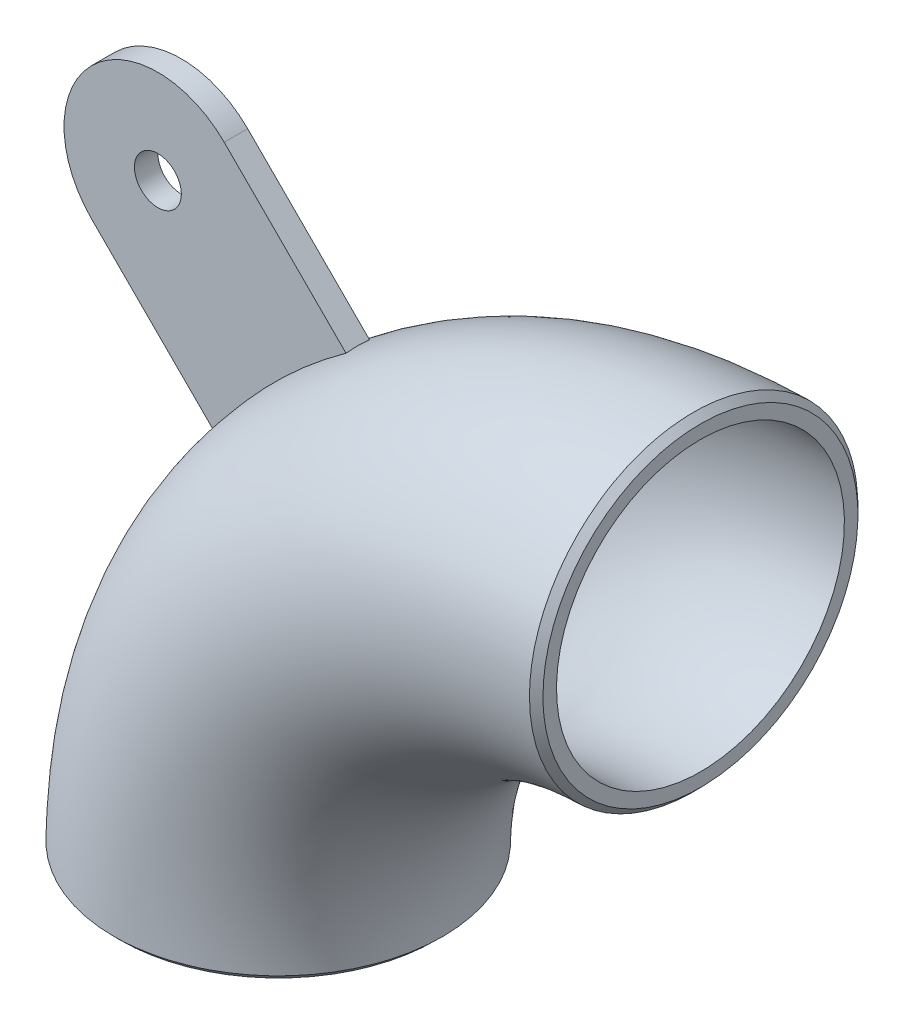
ISO-10303-21;
HEADER;
FILE_DESCRIPTION(('STEP AP214'),'2;1');
FILE_NAME('part.step','',(''),(''),'','','');
FILE_SCHEMA(('AUTOMOTIVE_DESIGN { 1 0 10303 214 1 1 1 1 }'));
ENDSEC;
DATA;
#1=APPLICATION_CONTEXT('core data for automotive mechanical design processes');
#2=APPLICATION_PROTOCOL_DEFINITION('international standard','automotive_design',2000,#1);
#3=PRODUCT_CONTEXT('',#1,'mechanical');
#4=PRODUCT('Part','Part','',(#3));
#5=PRODUCT_RELATED_PRODUCT_CATEGORY('part','',(#4));
#6=PRODUCT_DEFINITION_FORMATION('','',#4);
#7=PRODUCT_DEFINITION_CONTEXT('part definition',#1,'design');
#8=PRODUCT_DEFINITION('design','',#6,#7);
#9=PRODUCT_DEFINITION_SHAPE('','',#8);
#10=(LENGTH_UNIT() NAMED_UNIT(*) SI_UNIT(.MILLI.,.METRE.));
#11=(NAMED_UNIT(*) PLANE_ANGLE_UNIT() SI_UNIT($,.RADIAN.));
#12=(NAMED_UNIT(*) SI_UNIT($,.STERADIAN.) SOLID_ANGLE_UNIT());
#13=UNCERTAINTY_MEASURE_WITH_UNIT(LENGTH_MEASURE(1.E-05),#10,'distance_accuracy_value','');
#14=(GEOMETRIC_REPRESENTATION_CONTEXT(3) GLOBAL_UNCERTAINTY_ASSIGNED_CONTEXT((#13)) GLOBAL_UNIT_ASSIGNED_CONTEXT((#10,
#11,#12)) REPRESENTATION_CONTEXT('',''));
#15=CARTESIAN_POINT('',(0.,0.,0.));
#16=DIRECTION('',(0.,0.,1.));
#17=DIRECTION('',(1.,0.,0.));
#18=AXIS2_PLACEMENT_3D('',#15,#16,#17);
#19=CARTESIAN_POINT('',(0.,0.,0.));
#20=DIRECTION('',(0.,0.,1.));
#21=DIRECTION('',(1.,0.,0.));
#22=AXIS2_PLACEMENT_3D('',#19,#20,#21);
#23=TOROIDAL_SURFACE('',#22,114.3,44.45);
#24=CARTESIAN_POINT('',(-114.300627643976,1.82881004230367,44.4499973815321));
#25=CARTESIAN_POINT('',(-115.051305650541,1.82930411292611,44.4499786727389));
#26=CARTESIAN_POINT('',(-115.801937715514,1.82978862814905,44.4305427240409));
#27=CARTESIAN_POINT('',(-117.305106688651,1.8307412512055,44.3534143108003));
#28=CARTESIAN_POINT('',(-118.057633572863,1.83120926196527,44.2955258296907));
#29=CARTESIAN_POINT('',(-119.558882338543,1.83212653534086,44.1420809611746));
#30=CARTESIAN_POINT('',(-120.30760399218,1.83257579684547,44.0465223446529));
#31=CARTESIAN_POINT('',(-121.795470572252,1.83345287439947,43.8175942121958));
#32=CARTESIAN_POINT('',(-122.534644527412,1.83388078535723,43.6844136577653));
#33=CARTESIAN_POINT('',(-124.00181660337,1.83471581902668,43.381509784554));
#34=CARTESIAN_POINT('',(-124.72985100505,1.83512303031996,43.2119619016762));
#35=CARTESIAN_POINT('',(-126.176096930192,1.83591890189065,42.8367034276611));
#36=CARTESIAN_POINT('',(-126.894313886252,1.83630757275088,42.6310137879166));
#37=CARTESIAN_POINT('',(-128.321120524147,1.83706747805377,42.182958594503));
#38=CARTESIAN_POINT('',(-129.029682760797,1.83743866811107,41.9405056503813));
#39=CARTESIAN_POINT('',(-130.437403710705,1.83816489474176,41.4189552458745));
#40=CARTESIAN_POINT('',(-131.136493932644,1.83851983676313,41.139672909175));
#41=CARTESIAN_POINT('',(-132.521102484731,1.8392124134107,40.5450619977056));
#42=CARTESIAN_POINT('',(-133.206585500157,1.83955000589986,40.2296511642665));
#43=CARTESIAN_POINT('',(-134.559861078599,1.84020699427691,39.5648314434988));
#44=CARTESIAN_POINT('',(-135.22767329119,1.84052641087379,39.2154625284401));
#45=CARTESIAN_POINT('',(-136.542617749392,1.84114679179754,38.4846611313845));
#46=CARTESIAN_POINT('',(-137.189811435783,1.84144781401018,38.1033392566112));
#47=CARTESIAN_POINT('',(-138.460684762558,1.8420311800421,37.3100365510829));
#48=CARTESIAN_POINT('',(-139.084464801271,1.84231360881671,36.8982165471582));
#49=CARTESIAN_POINT('',(-140.310698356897,1.84286201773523,36.043773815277));
#50=CARTESIAN_POINT('',(-140.913148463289,1.84312799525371,35.6011461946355));
#51=CARTESIAN_POINT('',(-142.096807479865,1.84364443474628,34.6847027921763));
#52=CARTESIAN_POINT('',(-142.6779455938,1.84389484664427,34.2107955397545));
#53=CARTESIAN_POINT('',(-143.81809421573,1.84438063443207,33.2318672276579));
#54=CARTESIAN_POINT('',(-144.376989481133,1.84461593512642,32.7267119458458));
#55=CARTESIAN_POINT('',(-145.470775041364,1.84507158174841,31.686415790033));
#56=CARTESIAN_POINT('',(-146.00555049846,1.84529185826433,31.1511541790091));
#57=CARTESIAN_POINT('',(-147.044387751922,1.84571556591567,30.056960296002));
#58=CARTESIAN_POINT('',(-147.548596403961,1.84591907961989,29.4981674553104));
#59=CARTESIAN_POINT('',(-148.525476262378,1.84630967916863,28.358422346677));
#60=CARTESIAN_POINT('',(-148.998290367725,1.84649684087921,27.7775925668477));
#61=CARTESIAN_POINT('',(-149.912763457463,1.84685570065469,26.5943951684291));
#62=CARTESIAN_POINT('',(-150.354502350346,1.84702743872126,25.992089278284));
#63=CARTESIAN_POINT('',(-151.207746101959,1.84735663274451,24.765608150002));
#64=CARTESIAN_POINT('',(-151.619223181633,1.84751407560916,24.1414135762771));
#65=CARTESIAN_POINT('',(-152.412053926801,1.84781523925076,22.8690464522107));
#66=CARTESIAN_POINT('',(-152.793215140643,1.84795887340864,22.2207539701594));
#67=CARTESIAN_POINT('',(-153.523616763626,1.84823229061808,20.9037795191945));
#68=CARTESIAN_POINT('',(-153.872753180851,1.84836202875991,20.2350399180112));
#69=CARTESIAN_POINT('',(-154.53660272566,1.84860723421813,18.8808596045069));
#70=CARTESIAN_POINT('',(-154.851323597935,1.848722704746,18.1954226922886));
#71=CARTESIAN_POINT('',(-155.444024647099,1.84893906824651,16.811854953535));
#72=CARTESIAN_POINT('',(-155.72213662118,1.84904001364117,16.1137805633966));
#73=CARTESIAN_POINT('',(-156.241802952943,1.84922781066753,14.7075457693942));
#74=CARTESIAN_POINT('',(-156.483508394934,1.84931472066,13.9994411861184));
#75=CARTESIAN_POINT('',(-156.930359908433,1.84947474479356,12.5728503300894));
#76=CARTESIAN_POINT('',(-157.135555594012,1.84954787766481,11.8543796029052));
#77=CARTESIAN_POINT('',(-157.509954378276,1.84968087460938,10.4068794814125));
#78=CARTESIAN_POINT('',(-157.679098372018,1.84974071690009,9.67783480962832));
#79=CARTESIAN_POINT('',(-157.981096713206,1.84984735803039,8.20857375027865));
#80=CARTESIAN_POINT('',(-158.113771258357,1.84989409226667,7.46832034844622));
#81=CARTESIAN_POINT('',(-158.341481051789,1.84997416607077,5.97918154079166));
#82=CARTESIAN_POINT('',(-158.436371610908,1.85000745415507,5.23027404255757));
#83=CARTESIAN_POINT('',(-158.588397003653,1.85006069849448,3.72925502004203));
#84=CARTESIAN_POINT('',(-158.64556249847,1.85008066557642,2.97714659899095));
#85=CARTESIAN_POINT('',(-158.721112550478,1.8501070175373,1.47508507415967));
#86=CARTESIAN_POINT('',(-158.739706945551,1.85011347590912,0.72514259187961));
#87=CARTESIAN_POINT('',(-158.738719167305,1.85011313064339,-0.771133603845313));
#88=CARTESIAN_POINT('',(-158.719318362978,1.85010639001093,-1.51746749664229));
#89=CARTESIAN_POINT('',(-158.64330942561,1.85007987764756,-3.00886043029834));
#90=CARTESIAN_POINT('',(-158.5866704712,1.85006009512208,-3.75391790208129));
#91=CARTESIAN_POINT('',(-158.435414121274,1.85000711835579,-5.242894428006));
#92=CARTESIAN_POINT('',(-158.340660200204,1.84997387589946,-5.98679963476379));
#93=CARTESIAN_POINT('',(-158.112936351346,1.84989379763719,-7.47356963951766));
#94=CARTESIAN_POINT('',(-157.979727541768,1.84984687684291,-8.21639782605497));
#95=CARTESIAN_POINT('',(-157.675587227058,1.84973947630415,-9.69478962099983));
#96=CARTESIAN_POINT('',(-157.50463158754,1.84967898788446,-10.4303482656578));
#97=CARTESIAN_POINT('',(-157.126160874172,1.84954452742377,-11.8890454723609));
#98=CARTESIAN_POINT('',(-156.918785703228,1.84947060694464,-12.6122203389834));
#99=CARTESIAN_POINT('',(-156.468462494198,1.8493093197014,-14.0445890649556));
#100=CARTESIAN_POINT('',(-156.225643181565,1.84922200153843,-14.753823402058));
#101=CARTESIAN_POINT('',(-155.705325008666,1.84903392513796,-16.1569136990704));
#102=CARTESIAN_POINT('',(-155.427937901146,1.84893321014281,-16.8508110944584));
#103=CARTESIAN_POINT('',(-154.837839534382,1.84871775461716,-18.2250458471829));
#104=CARTESIAN_POINT('',(-154.525059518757,1.84860298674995,-18.9053536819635));
#105=CARTESIAN_POINT('',(-153.864380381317,1.84835893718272,-20.2518005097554));
#106=CARTESIAN_POINT('',(-153.516356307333,1.848229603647,-20.9178781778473));
#107=CARTESIAN_POINT('',(-152.78589143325,1.84795612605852,-22.2337194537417));
#108=CARTESIAN_POINT('',(-152.403342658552,1.84781193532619,-22.8834231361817));
#109=CARTESIAN_POINT('',(-151.604759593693,1.84750855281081,-24.1638102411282));
#110=CARTESIAN_POINT('',(-151.188656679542,1.8473493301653,-24.7944508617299));
#111=CARTESIAN_POINT('',(-150.327232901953,1.84701687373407,-26.0305199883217));
#112=CARTESIAN_POINT('',(-149.882077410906,1.84684371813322,-26.6360637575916));
#113=CARTESIAN_POINT('',(-148.963694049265,1.84648311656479,-27.8209181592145));
#114=CARTESIAN_POINT('',(-148.490608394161,1.84629574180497,-28.4003389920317));
#115=CARTESIAN_POINT('',(-147.516645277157,1.84590612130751,-29.5334785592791));
#116=CARTESIAN_POINT('',(-147.015820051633,1.84570390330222,-30.0872422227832));
#117=CARTESIAN_POINT('',(-145.986332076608,1.84528392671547,-31.1702070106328));
#118=CARTESIAN_POINT('',(-145.457620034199,1.84506614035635,-31.6993613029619));
#119=CARTESIAN_POINT('',(-144.37006338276,1.84461304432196,-32.7332261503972));
#120=CARTESIAN_POINT('',(-143.811041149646,1.84437762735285,-33.2377499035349));
#121=CARTESIAN_POINT('',(-142.666728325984,1.84388999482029,-34.21947083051));
#122=CARTESIAN_POINT('',(-142.081366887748,1.84363773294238,-34.696585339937));
#123=CARTESIAN_POINT('',(-140.888499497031,1.84311719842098,-35.6196978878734));
#124=CARTESIAN_POINT('',(-140.281041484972,1.84284895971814,-36.0657578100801));
#125=CARTESIAN_POINT('',(-139.047428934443,1.84229694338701,-36.9233907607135));
#126=CARTESIAN_POINT('',(-138.42140185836,1.84201326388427,-37.3351471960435));
#127=CARTESIAN_POINT('',(-137.151351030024,1.84142993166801,-38.1258312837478));
#128=CARTESIAN_POINT('',(-136.507381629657,1.84113032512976,-38.5048462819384));
#129=CARTESIAN_POINT('',(-135.200787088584,1.84051365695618,-39.2299656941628));
#130=CARTESIAN_POINT('',(-134.538153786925,1.84019658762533,-39.576055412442));
#131=CARTESIAN_POINT('',(-133.193962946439,1.83954379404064,-40.2354975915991));
#132=CARTESIAN_POINT('',(-132.512348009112,1.83920800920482,-40.5487329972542));
#133=CARTESIAN_POINT('',(-131.130864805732,1.83851696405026,-41.1418642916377));
#134=CARTESIAN_POINT('',(-130.430924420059,1.83816161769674,-41.4215922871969));
#135=CARTESIAN_POINT('',(-129.0169655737,1.83743207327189,-41.9450879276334));
#136=CARTESIAN_POINT('',(-128.302934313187,1.83705785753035,-42.1888209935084));
#137=CARTESIAN_POINT('',(-126.864843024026,1.83629169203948,-42.6395336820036));
#138=CARTESIAN_POINT('',(-126.140804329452,1.83589977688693,-42.846581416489));
#139=CARTESIAN_POINT('',(-124.686515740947,1.83509907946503,-43.2227731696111));
#140=CARTESIAN_POINT('',(-123.956310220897,1.83469038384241,-43.3920885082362));
#141=CARTESIAN_POINT('',(-122.49072946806,1.833855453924,-43.6926102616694));
#142=CARTESIAN_POINT('',(-121.755380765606,1.83342928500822,-43.8239461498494));
#143=CARTESIAN_POINT('',(-120.277344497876,1.83255732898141,-44.0498713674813));
#144=CARTESIAN_POINT('',(-119.534644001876,1.8321114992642,-44.1443760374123));
#145=CARTESIAN_POINT('',(-118.042950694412,1.83119960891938,-44.2960973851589));
#146=CARTESIAN_POINT('',(-117.293945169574,1.83073348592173,-44.3531889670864));
#147=CARTESIAN_POINT('',(-115.790780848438,1.82978087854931,-44.4300787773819));
#148=CARTESIAN_POINT('',(-115.03661375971,1.82929431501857,-44.4497150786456));
#149=CARTESIAN_POINT('',(-113.526454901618,1.82830063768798,-44.4502854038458));
#150=CARTESIAN_POINT('',(-112.770463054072,1.82779347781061,-44.4311273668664));
#151=CARTESIAN_POINT('',(-111.260791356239,1.8267598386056,-44.3535501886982));
#152=CARTESIAN_POINT('',(-110.50711073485,1.82623336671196,-44.2951460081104));
#153=CARTESIAN_POINT('',(-109.004270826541,1.82516266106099,-44.1400635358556));
#154=CARTESIAN_POINT('',(-108.25510861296,1.82461844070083,-44.0434135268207));
#155=CARTESIAN_POINT('',(-106.76352438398,1.82351339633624,-43.8124583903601));
#156=CARTESIAN_POINT('',(-106.021095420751,1.82295259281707,-43.6781981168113));
#157=CARTESIAN_POINT('',(-104.545195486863,1.82181564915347,-43.3727384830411));
#158=CARTESIAN_POINT('',(-103.811711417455,1.82123953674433,-43.2016023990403));
#159=CARTESIAN_POINT('',(-102.355926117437,1.82007320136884,-42.8230687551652));
#160=CARTESIAN_POINT('',(-101.633603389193,1.81948301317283,-42.6157538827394));
#161=CARTESIAN_POINT('',(-100.202352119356,1.81828980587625,-42.1655851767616));
#162=CARTESIAN_POINT('',(-99.4933915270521,1.81768682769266,-41.9228333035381));
#163=CARTESIAN_POINT('',(-98.0909171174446,1.8164689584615,-41.4022852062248));
#164=CARTESIAN_POINT('',(-97.3973626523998,1.81585410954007,-41.1245985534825));
#165=CARTESIAN_POINT('',(-96.0232437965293,1.81461020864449,-40.5333797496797));
#166=CARTESIAN_POINT('',(-95.3427246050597,1.81398111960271,-40.2197425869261));
#167=CARTESIAN_POINT('',(-93.9955076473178,1.81271042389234,-39.5572318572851));
#168=CARTESIAN_POINT('',(-93.3288801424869,1.81206877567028,-39.2082154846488));
#169=CARTESIAN_POINT('',(-92.0124255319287,1.81077617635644,-38.4760651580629));
#170=CARTESIAN_POINT('',(-91.362644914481,1.81012520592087,-38.0928475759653));
#171=CARTESIAN_POINT('',(-90.0833162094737,1.80881749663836,-37.2935020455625));
#172=CARTESIAN_POINT('',(-89.4537757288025,1.8081607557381,-36.8773619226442));
#173=CARTESIAN_POINT('',(-88.2198488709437,1.80684784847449,-36.0159812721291));
#174=CARTESIAN_POINT('',(-87.6153477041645,1.8061916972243,-35.5709051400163));
#175=CARTESIAN_POINT('',(-86.432113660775,1.80488259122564,-34.6524775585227));
#176=CARTESIAN_POINT('',(-85.853286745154,1.80422963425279,-34.1792473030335));
#177=CARTESIAN_POINT('',(-84.7208877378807,1.80292830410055,-33.2046596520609));
#178=CARTESIAN_POINT('',(-84.1672898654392,1.80227992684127,-32.7033321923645));
#179=CARTESIAN_POINT('',(-83.0843118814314,1.80098850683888,-31.6724632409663));
#180=CARTESIAN_POINT('',(-82.5549970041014,1.80034548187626,-31.1428531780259));
#181=CARTESIAN_POINT('',(-81.5210247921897,1.79906671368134,-30.0536206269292));
#182=CARTESIAN_POINT('',(-81.0165467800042,1.79843104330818,-29.4938278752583));
#183=CARTESIAN_POINT('',(-80.0352593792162,1.79717393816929,-28.3483200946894));
#184=CARTESIAN_POINT('',(-79.5585152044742,1.79655253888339,-27.7625492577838));
#185=CARTESIAN_POINT('',(-78.6365283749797,1.79533157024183,-26.5693574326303));
#186=CARTESIAN_POINT('',(-78.1911998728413,1.79473194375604,-25.9620028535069));
#187=CARTESIAN_POINT('',(-77.3352926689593,1.79356131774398,-24.7289922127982));
#188=CARTESIAN_POINT('',(-76.924511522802,1.79299016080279,-24.1034766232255));
#189=CARTESIAN_POINT('',(-76.1353483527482,1.79187764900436,-22.8340452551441));
#190=CARTESIAN_POINT('',(-75.7569042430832,1.79133623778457,-22.1901680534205));
#191=CARTESIAN_POINT('',(-75.0325715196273,1.79028643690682,-20.8831898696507));
#192=CARTESIAN_POINT('',(-74.6867281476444,1.78977809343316,-20.2200637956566));
#193=CARTESIAN_POINT('',(-74.0275632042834,1.78879752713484,-18.8742446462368));
#194=CARTESIAN_POINT('',(-73.7143906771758,1.78832547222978,-18.1914786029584));
#195=CARTESIAN_POINT('',(-73.1215135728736,1.78742216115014,-16.8076900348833));
#196=CARTESIAN_POINT('',(-72.8419764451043,1.7869911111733,-16.1065957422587));
#197=CARTESIAN_POINT('',(-72.3193598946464,1.78617774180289,-14.691615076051));
#198=CARTESIAN_POINT('',(-72.0762502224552,1.78579538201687,-13.9777398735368));
#199=CARTESIAN_POINT('',(-71.6270338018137,1.78508291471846,-12.5404867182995));
#200=CARTESIAN_POINT('',(-71.4208322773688,1.78475267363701,-11.8171383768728));
#201=CARTESIAN_POINT('',(-71.0462036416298,1.78414843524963,-10.3639537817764));
#202=CARTESIAN_POINT('',(-70.8776216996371,1.78387420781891,-9.63415747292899));
#203=CARTESIAN_POINT('',(-70.5781448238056,1.78338485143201,-8.16882285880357));
#204=CARTESIAN_POINT('',(-70.4471545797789,1.78316957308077,-7.43330401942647));
#205=CARTESIAN_POINT('',(-70.2218923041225,1.78279807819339,-5.95471292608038));
#206=CARTESIAN_POINT('',(-70.1277164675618,1.78264201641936,-5.21162602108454));
#207=CARTESIAN_POINT('',(-69.9767903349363,1.78239105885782,-3.71880725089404));
#208=CARTESIAN_POINT('',(-69.9201834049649,1.78229639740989,-2.96906087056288));
#209=CARTESIAN_POINT('',(-69.8449457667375,1.78217024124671,-1.46391178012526));
#210=CARTESIAN_POINT('',(-69.8265061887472,1.7821390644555,-0.708499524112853));
#211=CARTESIAN_POINT('',(-69.8280658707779,1.78214166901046,0.801496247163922));
#212=CARTESIAN_POINT('',(-69.8480250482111,1.78217538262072,1.55607980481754));
#213=CARTESIAN_POINT('',(-69.9261678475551,1.78230636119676,3.05858807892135));
#214=CARTESIAN_POINT('',(-69.9841141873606,1.78240323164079,3.80652510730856));
#215=CARTESIAN_POINT('',(-70.1376915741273,1.78265852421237,5.29573172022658));
#216=CARTESIAN_POINT('',(-70.2331832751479,1.78281671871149,6.03701570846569));
#217=CARTESIAN_POINT('',(-70.4608451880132,1.7831920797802,7.51305578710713));
#218=CARTESIAN_POINT('',(-70.5929729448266,1.78340917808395,8.24781842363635));
#219=CARTESIAN_POINT('',(-70.8951773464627,1.78390279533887,9.71325967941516));
#220=CARTESIAN_POINT('',(-71.0654366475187,1.78417960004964,10.4439006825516));
#221=CARTESIAN_POINT('',(-71.4436803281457,1.78478929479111,11.8991881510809));
#222=CARTESIAN_POINT('',(-71.6518467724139,1.78512245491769,12.6237872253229));
#223=CARTESIAN_POINT('',(-72.1045724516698,1.78584000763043,14.062369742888));
#224=CARTESIAN_POINT('',(-72.349169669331,1.78622445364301,14.7763412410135));
#225=CARTESIAN_POINT('',(-72.874037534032,1.78704067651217,16.1888036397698));
#226=CARTESIAN_POINT('',(-73.1542075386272,1.78747231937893,16.8873319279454));
#227=CARTESIAN_POINT('',(-73.7481094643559,1.78837642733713,18.2660646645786));
#228=CARTESIAN_POINT('',(-74.0616771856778,1.78884869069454,18.9463398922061));
#229=CARTESIAN_POINT('',(-74.7219890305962,1.78983016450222,20.2886228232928));
#230=CARTESIAN_POINT('',(-75.0686536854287,1.79033928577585,20.950669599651));
#231=CARTESIAN_POINT('',(-75.7952963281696,1.7913914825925,22.2567867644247));
#232=CARTESIAN_POINT('',(-76.1752962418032,1.79193458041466,22.9008449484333));
#233=CARTESIAN_POINT('',(-76.9684170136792,1.7930514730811,24.1715423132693));
#234=CARTESIAN_POINT('',(-77.3816547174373,1.79362537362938,24.7981085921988));
#235=CARTESIAN_POINT('',(-78.2417827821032,1.79480037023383,26.0320694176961));
#236=CARTESIAN_POINT('',(-78.6888215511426,1.79540158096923,26.6393605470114));
#237=CARTESIAN_POINT('',(-79.6134235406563,1.79662447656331,27.8311681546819));
#238=CARTESIAN_POINT('',(-80.0910160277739,1.79724618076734,28.4156619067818));
#239=CARTESIAN_POINT('',(-81.0734426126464,1.79850307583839,29.5579378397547));
#240=CARTESIAN_POINT('',(-81.5781809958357,1.79913821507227,30.1158022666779));
#241=CARTESIAN_POINT('',(-82.6124484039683,1.80041564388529,31.2012222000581));
#242=CARTESIAN_POINT('',(-83.1417971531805,1.8010578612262,31.7289495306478));
#243=CARTESIAN_POINT('',(-84.2255268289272,1.80234851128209,32.7568816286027));
#244=CARTESIAN_POINT('',(-84.7798814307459,1.80299693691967,33.2571141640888));
#245=CARTESIAN_POINT('',(-85.9145433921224,1.80429917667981,34.2301981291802));
#246=CARTESIAN_POINT('',(-86.4949120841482,1.80495300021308,34.7029780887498));
#247=CARTESIAN_POINT('',(-87.6819384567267,1.8062644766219,35.6208914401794));
#248=CARTESIAN_POINT('',(-88.2887170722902,1.80692213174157,36.0658684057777));
#249=CARTESIAN_POINT('',(-89.5271487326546,1.80823778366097,36.9267277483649));
#250=CARTESIAN_POINT('',(-90.1589123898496,1.80889576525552,37.3424510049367));
#251=CARTESIAN_POINT('',(-91.44045735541,1.81020358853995,38.1396113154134));
#252=CARTESIAN_POINT('',(-92.0901629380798,1.81085345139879,38.5211701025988));
#253=CARTESIAN_POINT('',(-93.4055173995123,1.81214283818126,39.2493430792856));
#254=CARTESIAN_POINT('',(-94.0710932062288,1.81278239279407,39.5960892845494));
#255=CARTESIAN_POINT('',(-95.4167031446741,1.8140495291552,40.2544494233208));
#256=CARTESIAN_POINT('',(-96.0966829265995,1.8146771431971,40.5661744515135));
#257=CARTESIAN_POINT('',(-97.4710616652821,1.81591993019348,41.1547682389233));
#258=CARTESIAN_POINT('',(-98.1654512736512,1.8165351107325,41.431658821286));
#259=CARTESIAN_POINT('',(-99.5702230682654,1.8177545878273,41.9509959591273));
#260=CARTESIAN_POINT('',(-100.280659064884,1.81835882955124,42.1932969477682));
#261=CARTESIAN_POINT('',(-101.715232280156,1.81955474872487,42.6425375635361));
#262=CARTESIAN_POINT('',(-102.43940737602,1.82014637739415,42.8493562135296));
#263=CARTESIAN_POINT('',(-103.899086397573,1.82131511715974,43.2264015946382));
#264=CARTESIAN_POINT('',(-104.634613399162,1.82189218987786,43.3965390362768));
#265=CARTESIAN_POINT('',(-106.112032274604,1.82302813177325,43.6988119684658));
#266=CARTESIAN_POINT('',(-106.853910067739,1.82358703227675,43.8310163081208));
#267=CARTESIAN_POINT('',(-108.339098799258,1.82468412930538,44.0569646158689));
#268=CARTESIAN_POINT('',(-109.08237646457,1.82522242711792,44.1509272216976));
#269=CARTESIAN_POINT('',(-110.570559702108,1.82627949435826,44.3007751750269));
#270=CARTESIAN_POINT('',(-111.31545414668,1.82679831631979,44.3567711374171));
#271=CARTESIAN_POINT('',(-112.807114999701,1.8278178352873,44.4313690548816));
#272=CARTESIAN_POINT('',(-113.553881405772,1.82831853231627,44.4499710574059));
#273=CARTESIAN_POINT('',(-114.300627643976,1.82881004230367,44.4499973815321));
#274=B_SPLINE_CURVE_WITH_KNOTS('',3,(#24,#25,#26,#27,#28,#29,#30,#31,#32,#33,#34,#35,#36,#37,
#38,#39,#40,#41,#42,#43,#44,#45,#46,#47,#48,#49,#50,#51,#52,#53,#54,#55,#56,#57,#58,#59,#60,#61,
#62,#63,#64,#65,#66,#67,#68,#69,#70,#71,#72,#73,#74,#75,#76,#77,#78,#79,#80,#81,#82,#83,#84,#85,
#86,#87,#88,#89,#90,#91,#92,#93,#94,#95,#96,#97,#98,#99,#100,#101,#102,#103,#104,#105,#106,#107,
#108,#109,#110,#111,#112,#113,#114,#115,#116,#117,#118,#119,#120,#121,#122,#123,#124,#125,#126,
#127,#128,#129,#130,#131,#132,#133,#134,#135,#136,#137,#138,#139,#140,#141,#142,#143,#144,#145,
#146,#147,#148,#149,#150,#151,#152,#153,#154,#155,#156,#157,#158,#159,#160,#161,#162,#163,#164,
#165,#166,#167,#168,#169,#170,#171,#172,#173,#174,#175,#176,#177,#178,#179,#180,#181,#182,#183,
#184,#185,#186,#187,#188,#189,#190,#191,#192,#193,#194,#195,#196,#197,#198,#199,#200,#201,#202,
#203,#204,#205,#206,#207,#208,#209,#210,#211,#212,#213,#214,#215,#216,#217,#218,#219,#220,#221,
#222,#223,#224,#225,#226,#227,#228,#229,#230,#231,#232,#233,#234,#235,#236,#237,#238,#239,#240,
#241,#242,#243,#244,#245,#246,#247,#248,#249,#250,#251,#252,#253,#254,#255,#256,#257,#258,#259,
#260,#261,#262,#263,#264,#265,#266,#267,#268,#269,#270,#271,#272,#273),.UNSPECIFIED.,.F.,.F.,(4,
2,2,2,2,2,2,2,2,2,2,2,2,2,2,2,2,2,2,2,2,2,2,2,2,2,2,2,2,2,2,2,2,2,2,2,2,2,2,2,2,2,2,2,2,2,2,2,2,
2,2,2,2,2,2,2,2,2,2,2,2,2,2,2,2,2,2,2,2,2,2,2,2,2,2,2,2,2,2,2,2,2,2,2,2,2,2,2,2,2,2,2,2,2,2,2,2,
2,2,2,2,2,2,2,2,2,2,2,2,2,2,2,2,2,2,2,2,2,2,2,2,2,2,2,4),(0.,2.25171452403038,4.51499644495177,
6.77841231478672,9.03065603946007,11.2722699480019,13.5125886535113,15.75831884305,
18.0157848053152,20.2784968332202,22.5385769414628,24.7911335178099,27.0325581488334,
29.274339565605,31.5229949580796,33.7820889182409,36.0509974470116,38.3079626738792,
40.5538287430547,42.7936909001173,45.0355841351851,47.2907301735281,49.5529575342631,
51.8146747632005,54.0680127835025,56.3117254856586,58.5523654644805,60.7966510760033,
63.0518107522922,65.3155250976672,67.5773973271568,69.8269316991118,72.0657541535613,
74.3064319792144,76.5552082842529,78.8182661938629,81.0827752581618,83.3387684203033,
85.5867632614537,87.8276705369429,90.0730083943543,92.3266056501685,94.5875128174,
96.853167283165,99.1068927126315,101.34999476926,103.589007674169,105.832120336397,
108.090210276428,110.354787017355,112.614713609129,114.861656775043,117.102407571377,
119.34415384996,121.593633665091,123.853950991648,126.116425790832,128.374654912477,
130.622411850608,132.862413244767,135.10753351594,137.360122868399,139.622428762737,
141.890109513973,144.156926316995,146.422069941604,148.68452358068,150.943125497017,
153.196631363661,155.443776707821,157.684041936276,159.931026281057,162.18747176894,
164.449594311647,166.712557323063,168.963629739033,171.205629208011,173.445283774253,
175.690639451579,177.950353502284,180.215182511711,182.473561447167,184.717619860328,
186.957268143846,189.199980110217,191.452512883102,193.715832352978,195.977261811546,
198.232798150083,200.478872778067,202.71920134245,204.965345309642,207.2200122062,
209.485942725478,211.749509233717,213.999069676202,216.240358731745,218.479061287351,
220.728726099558,222.989495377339,225.252638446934,227.509515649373,229.755768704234,
231.996757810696,234.239232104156,236.489966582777,238.751231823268,241.014696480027,
243.270645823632,245.512089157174,247.75122552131,249.995951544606,252.252341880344,
254.52018371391,256.779593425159,259.030082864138,261.273218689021,263.514942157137,
265.765837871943,268.024261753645,270.288122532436,272.547847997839,274.794466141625,
277.034510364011,279.274551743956),.UNSPECIFIED.);
#275=CARTESIAN_POINT('',(-114.300627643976,1.82881004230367,44.4499973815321));
#276=VERTEX_POINT('',#275);
#277=EDGE_CURVE('E198',#276,#276,#274,.F.);
#278=ORIENTED_EDGE('',*,*,#277,.T.);
#279=EDGE_LOOP('',(#278));
#280=FACE_BOUND('',#279,.T.);
#281=CARTESIAN_POINT('',(-1.82881004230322,114.300627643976,44.4499973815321));
#282=CARTESIAN_POINT('',(-1.82690506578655,111.404582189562,44.4523577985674));
#283=CARTESIAN_POINT('',(-1.82481749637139,108.450985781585,44.1621891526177));
#284=CARTESIAN_POINT('',(-1.82045951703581,102.760609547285,43.0269516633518));
#285=CARTESIAN_POINT('',(-1.8181721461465,99.9918386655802,42.1904146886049));
#286=CARTESIAN_POINT('',(-1.81334004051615,94.5929568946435,39.9587172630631));
#287=CARTESIAN_POINT('',(-1.81081857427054,91.9958213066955,38.5688406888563));
#288=CARTESIAN_POINT('',(-1.80578363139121,87.1876225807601,35.3555770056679));
#289=CARTESIAN_POINT('',(-1.80323104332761,84.9345345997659,33.514421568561));
#290=CARTESIAN_POINT('',(-1.79818882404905,80.7802379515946,29.36306232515));
#291=CARTESIAN_POINT('',(-1.79577724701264,78.9411060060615,27.1156575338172));
#292=CARTESIAN_POINT('',(-1.79133093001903,75.7235552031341,22.3102888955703));
#293=CARTESIAN_POINT('',(-1.78926984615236,74.328559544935,19.7072771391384));
#294=CARTESIAN_POINT('',(-1.78585126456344,72.0972620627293,14.3189540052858));
#295=CARTESIAN_POINT('',(-1.78449646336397,71.2578319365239,11.5514772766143));
#296=CARTESIAN_POINT('',(-1.7826312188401,70.1175974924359,5.85345316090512));
#297=CARTESIAN_POINT('',(-1.78213905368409,69.826491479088,2.90255246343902));
#298=CARTESIAN_POINT('',(-1.7821416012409,69.8280336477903,-2.88498439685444));
#299=CARTESIAN_POINT('',(-1.78261159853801,70.105849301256,-5.76764138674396));
#300=CARTESIAN_POINT('',(-1.78447788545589,71.2462289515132,-11.519946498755));
#301=CARTESIAN_POINT('',(-1.78585229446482,72.0979514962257,-14.3181139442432));
#302=CARTESIAN_POINT('',(-1.78923969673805,74.308860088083,-19.6622075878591));
#303=CARTESIAN_POINT('',(-1.79127607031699,75.6850274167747,-22.2469607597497));
#304=CARTESIAN_POINT('',(-1.79577828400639,78.9407007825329,-27.120743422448));
#305=CARTESIAN_POINT('',(-1.79818578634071,80.7799346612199,-29.3564991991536));
#306=CARTESIAN_POINT('',(-1.80315377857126,84.86869823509,-33.4548223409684));
#307=CARTESIAN_POINT('',(-1.80575567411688,87.1604985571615,-35.338367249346));
#308=CARTESIAN_POINT('',(-1.81081171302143,91.9896939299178,-38.5638324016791));
#309=CARTESIAN_POINT('',(-1.81328776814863,94.5386368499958,-39.930304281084));
#310=CARTESIAN_POINT('',(-1.81811837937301,99.9277720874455,-42.1697643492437));
#311=CARTESIAN_POINT('',(-1.82045281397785,102.751116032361,-43.0260941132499));
#312=CARTESIAN_POINT('',(-1.82479525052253,108.422674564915,-44.1555133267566));
#313=CARTESIAN_POINT('',(-1.82684770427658,111.321441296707,-44.4454962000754));
#314=CARTESIAN_POINT('',(-1.83263597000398,120.10899888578,-44.4589668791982));
#315=CARTESIAN_POINT('',(-1.83591446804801,125.969241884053,-43.2743432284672));
#316=CARTESIAN_POINT('',(-1.83995106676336,133.980094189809,-39.9547866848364));
#317=CARTESIAN_POINT('',(-1.84117856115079,136.57309728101,-38.5713846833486));
#318=CARTESIAN_POINT('',(-1.84337428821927,141.436155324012,-35.3171968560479));
#319=CARTESIAN_POINT('',(-1.84432840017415,143.669795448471,-33.4783439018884));
#320=CARTESIAN_POINT('',(-1.84601879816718,147.769989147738,-29.3820936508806));
#321=CARTESIAN_POINT('',(-1.84675997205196,149.652665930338,-27.0870426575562));
#322=CARTESIAN_POINT('',(-1.84799324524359,152.869256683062,-22.2629651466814));
#323=CARTESIAN_POINT('',(-1.84849873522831,154.235276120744,-19.7129919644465));
#324=CARTESIAN_POINT('',(-1.84931409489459,156.474424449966,-14.3104294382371));
#325=CARTESIAN_POINT('',(-1.84961575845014,157.324897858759,-11.4955036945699));
#326=CARTESIAN_POINT('',(-1.85001290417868,158.450276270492,-5.82269695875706));
#327=CARTESIAN_POINT('',(-1.85011360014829,158.740062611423,-2.92342044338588));
#328=CARTESIAN_POINT('',(-1.85011300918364,158.738371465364,2.94834780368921));
#329=CARTESIAN_POINT('',(-1.85001216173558,158.448182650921,5.83481595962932));
#330=CARTESIAN_POINT('',(-1.84961478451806,157.322127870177,11.507853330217));
#331=CARTESIAN_POINT('',(-1.84931059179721,156.464670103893,14.3382057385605));
#332=CARTESIAN_POINT('',(-1.8484971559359,154.231073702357,19.7188851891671));
#333=CARTESIAN_POINT('',(-1.84799244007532,152.866944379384,22.2687352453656));
#334=CARTESIAN_POINT('',(-1.84675424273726,149.637938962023,27.1067923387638));
#335=CARTESIAN_POINT('',(-1.84601368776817,147.757310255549,29.3959500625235));
#336=CARTESIAN_POINT('',(-1.84432553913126,143.663136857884,33.4838184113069));
#337=CARTESIAN_POINT('',(-1.84337019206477,141.426363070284,35.3257775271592));
#338=CARTESIAN_POINT('',(-1.84116678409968,136.54774175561,38.5863049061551));
#339=CARTESIAN_POINT('',(-1.83994651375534,133.970171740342,39.9589877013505));
#340=CARTESIAN_POINT('',(-1.83725334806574,128.627216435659,42.1728356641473));
#341=CARTESIAN_POINT('',(-1.83575944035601,125.821492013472,43.0272902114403));
#342=CARTESIAN_POINT('',(-1.8324732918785,120.077135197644,44.1680089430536));
#343=CARTESIAN_POINT('',(-1.8307150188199,117.196673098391,44.4476369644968));
#344=CARTESIAN_POINT('',(-1.82881004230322,114.300627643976,44.4499973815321));
#345=B_SPLINE_CURVE_WITH_KNOTS('',3,(#281,#282,#283,#284,#285,#286,#287,#288,#289,#290,#291,
#292,#293,#294,#295,#296,#297,#298,#299,#300,#301,#302,#303,#304,#305,#306,#307,#308,#309,#310,
#311,#312,#313,#314,#315,#316,#317,#318,#319,#320,#321,#322,#323,#324,#325,#326,#327,#328,#329,
#330,#331,#332,#333,#334,#335,#336,#337,#338,#339,#340,#341,#342,#343,#344),.UNSPECIFIED.,.T.,
.F.,(4,2,2,2,2,2,2,2,2,2,2,2,2,2,2,2,2,2,2,2,2,2,2,2,2,2,2,2,2,2,2,4),(-0.262009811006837,
-0.253681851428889,-0.245353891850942,-0.237025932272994,-0.228697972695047,-0.220370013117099,
-0.212042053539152,-0.203714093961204,-0.195386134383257,-0.187058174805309,-0.178730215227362,
-0.170402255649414,-0.162074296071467,-0.153746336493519,-0.145418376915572,-0.137090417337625,
-0.128762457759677,-0.112106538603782,-0.103778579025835,-0.0954506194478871,
-0.0871226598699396,-0.0787947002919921,-0.0704667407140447,-0.0621387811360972,
-0.0538108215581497,-0.0454828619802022,-0.0371549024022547,-0.0288269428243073,
-0.0204989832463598,-0.0121710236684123,-0.00384306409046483,0.00448489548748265),.UNSPECIFIED.);
#346=CARTESIAN_POINT('',(-1.82881004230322,114.300627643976,44.4499973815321));
#347=VERTEX_POINT('',#346);
#348=EDGE_CURVE('E220',#347,#347,#345,.F.);
#349=ORIENTED_EDGE('',*,*,#348,.T.);
#350=EDGE_LOOP('',(#349));
#351=FACE_BOUND('',#350,.T.);
#352=CARTESIAN_POINT('',(-92.7651906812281,128.686215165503,3.1752));
#353=CARTESIAN_POINT('',(-92.7923131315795,128.713337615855,2.64657959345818));
#354=CARTESIAN_POINT('',(-92.8126575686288,128.733682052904,2.1172639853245));
#355=CARTESIAN_POINT('',(-92.839758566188,128.760783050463,1.05863164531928));
#356=CARTESIAN_POINT('',(-92.8465328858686,128.767557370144,0.52931582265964));
#357=CARTESIAN_POINT('',(-92.8465328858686,128.767557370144,-0.529315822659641));
#358=CARTESIAN_POINT('',(-92.839758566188,128.760783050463,-1.05863164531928));
#359=CARTESIAN_POINT('',(-92.8126575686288,128.733682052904,-2.1172639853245));
#360=CARTESIAN_POINT('',(-92.7923131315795,128.713337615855,-2.64657959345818));
#361=CARTESIAN_POINT('',(-92.7651906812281,128.686215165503,-3.1752));
#362=B_SPLINE_CURVE_WITH_KNOTS('',3,(#352,#353,#354,#355,#356,#357,#358,#359,#360,#361),
.UNSPECIFIED.,.F.,.F.,(4,2,2,2,4),(0.,1.58994307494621,3.17780403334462,4.76566499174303,
6.35560806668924),.UNSPECIFIED.);
#363=CARTESIAN_POINT('',(-92.7652009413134,128.686225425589,3.175));
#364=VERTEX_POINT('',#363);
#365=CARTESIAN_POINT('',(-92.7652009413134,128.686225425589,-3.175));
#366=VERTEX_POINT('',#365);
#367=EDGE_CURVE('E51',#364,#366,#362,.T.);
#368=ORIENTED_EDGE('',*,*,#367,.F.);
#369=CARTESIAN_POINT('',(0.,0.,3.175));
#370=DIRECTION('',(0.,0.,1.));
#371=DIRECTION('',(1.,0.,0.));
#372=AXIS2_PLACEMENT_3D('',#369,#370,#371);
#373=CIRCLE('',#372,158.636462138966);
#374=CARTESIAN_POINT('',(-128.68622542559,92.765200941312,3.175));
#375=VERTEX_POINT('',#374);
#376=EDGE_CURVE('E11',#364,#375,#373,.T.);
#377=ORIENTED_EDGE('',*,*,#376,.T.);
#378=CARTESIAN_POINT('',(-128.686215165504,92.7651906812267,-3.1752));
#379=CARTESIAN_POINT('',(-128.713337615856,92.792313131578,-2.64657959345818));
#380=CARTESIAN_POINT('',(-128.733682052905,92.8126575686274,-2.1172639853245));
#381=CARTESIAN_POINT('',(-128.760783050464,92.8397585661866,-1.05863164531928));
#382=CARTESIAN_POINT('',(-128.767557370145,92.8465328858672,-0.52931582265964));
#383=CARTESIAN_POINT('',(-128.767557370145,92.8465328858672,0.529315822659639));
#384=CARTESIAN_POINT('',(-128.760783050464,92.8397585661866,1.05863164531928));
#385=CARTESIAN_POINT('',(-128.733682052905,92.8126575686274,2.1172639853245));
#386=CARTESIAN_POINT('',(-128.713337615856,92.792313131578,2.64657959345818));
#387=CARTESIAN_POINT('',(-128.686215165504,92.7651906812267,3.1752));
#388=B_SPLINE_CURVE_WITH_KNOTS('',3,(#378,#379,#380,#381,#382,#383,#384,#385,#386,#387),
.UNSPECIFIED.,.F.,.F.,(4,2,2,2,4),(0.,1.58994307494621,3.17780403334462,4.76566499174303,
6.35560806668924),.UNSPECIFIED.);
#389=CARTESIAN_POINT('',(-128.68622542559,92.765200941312,-3.175));
#390=VERTEX_POINT('',#389);
#391=EDGE_CURVE('E90',#390,#375,#388,.T.);
#392=ORIENTED_EDGE('',*,*,#391,.F.);
#393=CARTESIAN_POINT('',(0.,0.,-3.175));
#394=DIRECTION('',(0.,0.,1.));
#395=DIRECTION('',(1.,0.,0.));
#396=AXIS2_PLACEMENT_3D('',#393,#394,#395);
#397=CIRCLE('',#396,158.636462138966);
#398=EDGE_CURVE('E45',#366,#390,#397,.T.);
#399=ORIENTED_EDGE('',*,*,#398,.F.);
#400=EDGE_LOOP('',(#368,#377,#392,#399));
#401=FACE_BOUND('',#400,.T.);
#402=ADVANCED_FACE('F34',(#280,#351,#401),#23,.T.);
#403=CARTESIAN_POINT('',(3.73696618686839E-13,114.3,0.));
#404=DIRECTION('',(1.,0.,0.));
#405=DIRECTION('',(0.,0.,1.));
#406=AXIS2_PLACEMENT_3D('',#403,#404,#405);
#407=PLANE('',#406);
#408=CARTESIAN_POINT('',(4.22542103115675E-13,114.3,42.6211974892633));
#409=CARTESIAN_POINT('',(4.24914154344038E-13,115.015968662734,42.6206802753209));
#410=CARTESIAN_POINT('',(4.27269445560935E-13,115.731944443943,42.6023554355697));
#411=CARTESIAN_POINT('',(4.31957852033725E-13,117.162146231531,42.5298544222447));
#412=CARTESIAN_POINT('',(4.34290965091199E-13,117.876372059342,42.475674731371));
#413=CARTESIAN_POINT('',(4.38952926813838E-13,119.303320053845,42.3310098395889));
#414=CARTESIAN_POINT('',(4.41281741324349E-13,120.016031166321,42.2404154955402));
#415=CARTESIAN_POINT('',(4.45969643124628E-13,121.440166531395,42.022743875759));
#416=CARTESIAN_POINT('',(4.48328827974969E-13,122.151558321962,41.8954542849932));
#417=CARTESIAN_POINT('',(4.53024191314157E-13,123.568151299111,41.6045841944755));
#418=CARTESIAN_POINT('',(4.55360323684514E-13,124.273339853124,41.4409421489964));
#419=CARTESIAN_POINT('',(4.59977094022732E-13,125.672676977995,41.0784256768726));
#420=CARTESIAN_POINT('',(4.62257858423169E-13,126.366849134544,40.8796422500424));
#421=CARTESIAN_POINT('',(4.66770940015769E-13,127.741937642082,40.4479441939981));
#422=CARTESIAN_POINT('',(4.69003394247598E-13,128.422890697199,40.2151464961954));
#423=CARTESIAN_POINT('',(4.73422378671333E-13,129.769408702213,39.7162546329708));
#424=CARTESIAN_POINT('',(4.75609056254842E-13,130.435024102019,39.4502966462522));
#425=CARTESIAN_POINT('',(4.79937966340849E-13,131.752508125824,38.8849541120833));
#426=CARTESIAN_POINT('',(4.82080163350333E-13,132.404365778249,38.585544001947));
#427=CARTESIAN_POINT('',(4.8631567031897E-13,133.694318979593,37.9532315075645));
#428=CARTESIAN_POINT('',(4.88408794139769E-13,134.332361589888,37.6202211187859));
#429=CARTESIAN_POINT('',(4.92541575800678E-13,135.593230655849,36.9209728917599));
#430=CARTESIAN_POINT('',(4.94580993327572E-13,136.215988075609,36.5546105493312));
#431=CARTESIAN_POINT('',(4.9859520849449E-13,137.444241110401,35.7892993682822));
#432=CARTESIAN_POINT('',(5.00569748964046E-13,138.049667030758,35.3902386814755));
#433=CARTESIAN_POINT('',(5.0444811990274E-13,139.236409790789,34.5639500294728));
#434=CARTESIAN_POINT('',(5.06352259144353E-13,139.817833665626,34.1368757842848));
#435=CARTESIAN_POINT('',(5.10080479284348E-13,140.95523833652,33.2559254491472));
#436=CARTESIAN_POINT('',(5.11904921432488E-13,141.511334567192,32.8021984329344));
#437=CARTESIAN_POINT('',(5.15470986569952E-13,142.598535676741,31.8683422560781));
#438=CARTESIAN_POINT('',(5.17212799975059E-13,143.129697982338,31.3882799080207));
#439=CARTESIAN_POINT('',(5.20611060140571E-13,144.168096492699,30.4017931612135));
#440=CARTESIAN_POINT('',(5.22267409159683E-13,144.675305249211,29.8953398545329));
#441=CARTESIAN_POINT('',(5.25499593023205E-13,145.666284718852,28.8536803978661));
#442=CARTESIAN_POINT('',(5.27074832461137E-13,146.14988104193,28.3183082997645));
#443=CARTESIAN_POINT('',(5.30144240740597E-13,147.091091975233,27.2221478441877));
#444=CARTESIAN_POINT('',(5.31638125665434E-13,147.548615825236,26.6612816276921));
#445=CARTESIAN_POINT('',(5.34540292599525E-13,148.434259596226,25.5177625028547));
#446=CARTESIAN_POINT('',(5.35948667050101E-13,148.862411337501,24.9351342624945));
#447=CARTESIAN_POINT('',(5.38676034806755E-13,149.686078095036,23.7514000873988));
#448=CARTESIAN_POINT('',(5.39995424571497E-13,150.081739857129,23.1503962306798));
#449=CARTESIAN_POINT('',(5.42505009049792E-13,150.841125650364,21.9315214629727));
#450=CARTESIAN_POINT('',(5.4369564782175E-13,151.204958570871,21.3137183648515));
#451=CARTESIAN_POINT('',(5.45964324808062E-13,151.900676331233,20.060801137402));
#452=CARTESIAN_POINT('',(5.47042422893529E-13,152.232578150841,19.4256964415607));
#453=CARTESIAN_POINT('',(5.49091587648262E-13,152.864741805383,18.1379863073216));
#454=CARTESIAN_POINT('',(5.50062382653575E-13,153.164923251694,17.4853414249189));
#455=CARTESIAN_POINT('',(5.51908795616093E-13,153.73339787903,16.1626283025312));
#456=CARTESIAN_POINT('',(5.52783940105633E-13,154.001532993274,15.4924920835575));
#457=CARTESIAN_POINT('',(5.54438712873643E-13,154.503729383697,14.1376118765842));
#458=CARTESIAN_POINT('',(5.55218089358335E-13,154.737701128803,13.452834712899));
#459=CARTESIAN_POINT('',(5.56663964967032E-13,155.170641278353,12.0731728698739));
#460=CARTESIAN_POINT('',(5.57330592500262E-13,155.369649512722,11.3783006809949));
#461=CARTESIAN_POINT('',(5.58533275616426E-13,155.731154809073,9.98273889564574));
#462=CARTESIAN_POINT('',(5.59069954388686E-13,155.893825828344,9.28209442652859));
#463=CARTESIAN_POINT('',(5.60011094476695E-13,156.182463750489,7.87677517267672));
#464=CARTESIAN_POINT('',(5.60416173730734E-13,156.308601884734,7.17213550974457));
#465=CARTESIAN_POINT('',(5.61118247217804E-13,156.525791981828,5.75657546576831));
#466=CARTESIAN_POINT('',(5.61415106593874E-13,156.616800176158,5.04564837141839));
#467=CARTESIAN_POINT('',(5.61889222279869E-13,156.762952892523,3.61743460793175));
#468=CARTESIAN_POINT('',(5.62066029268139E-13,156.817962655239,2.90013411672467));
#469=CARTESIAN_POINT('',(5.62288894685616E-13,156.891776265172,1.45921549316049));
#470=CARTESIAN_POINT('',(5.62334135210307E-13,156.910353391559,0.735585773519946));
#471=CARTESIAN_POINT('',(5.6231302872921E-13,156.910729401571,-0.712351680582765));
#472=CARTESIAN_POINT('',(5.62246578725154E-13,156.892494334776,-1.43665942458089));
#473=CARTESIAN_POINT('',(5.62014129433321E-13,156.819260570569,-2.87972068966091));
#474=CARTESIAN_POINT('',(5.61848638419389E-13,156.764449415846,-3.59848371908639));
#475=CARTESIAN_POINT('',(5.61401828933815E-13,156.618678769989,-5.02957315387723));
#476=CARTESIAN_POINT('',(5.61120952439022E-13,156.527857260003,-5.74191363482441));
#477=CARTESIAN_POINT('',(5.60424491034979E-13,156.310851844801,-7.1593658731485));
#478=CARTESIAN_POINT('',(5.60009244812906E-13,156.184756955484,-7.86449125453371));
#479=CARTESIAN_POINT('',(5.59065023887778E-13,155.896595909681,-9.26935636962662));
#480=CARTESIAN_POINT('',(5.58535743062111E-13,155.734432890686,-9.96907624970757));
#481=CARTESIAN_POINT('',(5.57372981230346E-13,155.374172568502,-11.3623828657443));
#482=CARTESIAN_POINT('',(5.5673906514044E-13,155.175924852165,-12.0559306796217));
#483=CARTESIAN_POINT('',(5.55356655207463E-13,154.744161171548,-13.4338909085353));
#484=CARTESIAN_POINT('',(5.54607875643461E-13,154.510557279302,-14.118275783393));
#485=CARTESIAN_POINT('',(5.52994403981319E-13,154.008500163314,-15.4746312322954));
#486=CARTESIAN_POINT('',(5.5212963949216E-13,153.740025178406,-16.1465937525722));
#487=CARTESIAN_POINT('',(5.5026891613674E-13,153.170690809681,-17.4728508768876));
#488=CARTESIAN_POINT('',(5.49273603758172E-13,152.869992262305,-18.1272145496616));
#489=CARTESIAN_POINT('',(5.4716576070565E-13,152.237122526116,-19.4170902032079));
#490=CARTESIAN_POINT('',(5.46053747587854E-13,151.905090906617,-20.0526706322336));
#491=CARTESIAN_POINT('',(5.43724851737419E-13,151.209704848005,-21.3053948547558));
#492=CARTESIAN_POINT('',(5.42508103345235E-13,150.84639053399,-21.9225609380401));
#493=CARTESIAN_POINT('',(5.39985726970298E-13,150.088783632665,-23.1393541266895));
#494=CARTESIAN_POINT('',(5.38679920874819E-13,149.694428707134,-23.7389424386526));
#495=CARTESIAN_POINT('',(5.35970503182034E-13,148.872809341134,-24.9207843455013));
#496=CARTESIAN_POINT('',(5.34566324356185E-13,148.445352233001,-25.5029040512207));
#497=CARTESIAN_POINT('',(5.31665238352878E-13,147.56043975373,-26.6464384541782));
#498=CARTESIAN_POINT('',(5.30168084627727E-13,147.102904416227,-27.2077912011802));
#499=CARTESIAN_POINT('',(5.27089776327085E-13,146.161228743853,-28.3054678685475));
#500=CARTESIAN_POINT('',(5.25508826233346E-13,145.67715308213,-28.8418472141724));
#501=CARTESIAN_POINT('',(5.22269035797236E-13,144.685060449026,-29.8854532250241));
#502=CARTESIAN_POINT('',(5.20610759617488E-13,144.177216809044,-30.3928447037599));
#503=CARTESIAN_POINT('',(5.17207773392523E-13,143.138165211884,-31.3804711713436));
#504=CARTESIAN_POINT('',(5.15463285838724E-13,142.607017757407,-31.8607698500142));
#505=CARTESIAN_POINT('',(5.11893531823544E-13,141.520521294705,-32.7944811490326));
#506=CARTESIAN_POINT('',(5.10068175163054E-13,140.965145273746,-33.2478623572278));
#507=CARTESIAN_POINT('',(5.06340984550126E-13,139.82982413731,-34.1277570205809));
#508=CARTESIAN_POINT('',(5.04438865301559E-13,139.249786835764,-34.5541514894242));
#509=CARTESIAN_POINT('',(5.005673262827E-13,138.065810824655,-35.3793248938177));
#510=CARTESIAN_POINT('',(4.98597603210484E-13,137.46176171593,-35.7779454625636));
#511=CARTESIAN_POINT('',(4.94590123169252E-13,136.234389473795,-36.5435170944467));
#512=CARTESIAN_POINT('',(4.92552405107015E-13,135.61107737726,-36.9104858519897));
#513=CARTESIAN_POINT('',(4.88420367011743E-13,134.348331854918,-37.6114874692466));
#514=CARTESIAN_POINT('',(4.86326208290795E-13,133.708944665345,-37.9456036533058));
#515=CARTESIAN_POINT('',(4.82088367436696E-13,132.416787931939,-38.5797665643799));
#516=CARTESIAN_POINT('',(4.79944927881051E-13,131.764085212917,-38.8799493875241));
#517=CARTESIAN_POINT('',(4.75610023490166E-13,130.446090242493,-39.4457676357));
#518=CARTESIAN_POINT('',(4.73418714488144E-13,129.780839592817,-39.7114999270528));
#519=CARTESIAN_POINT('',(4.6898435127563E-13,128.435578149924,-40.2095570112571));
#520=CARTESIAN_POINT('',(4.66741156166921E-13,127.755527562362,-40.4417742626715));
#521=CARTESIAN_POINT('',(4.62211209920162E-13,126.38264388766,-40.8723181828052));
#522=CARTESIAN_POINT('',(4.59924352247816E-13,125.689779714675,-41.0705456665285));
#523=CARTESIAN_POINT('',(4.55316116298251E-13,124.293390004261,-41.4323788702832));
#524=CARTESIAN_POINT('',(4.52994671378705E-13,123.589843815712,-41.5959048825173));
#525=CARTESIAN_POINT('',(4.48326187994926E-13,122.174229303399,-41.8876489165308));
#526=CARTESIAN_POINT('',(4.45979112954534E-13,121.462148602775,-42.0158068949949));
#527=CARTESIAN_POINT('',(4.41268597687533E-13,120.031601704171,-42.2360929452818));
#528=CARTESIAN_POINT('',(4.38905141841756E-13,119.313129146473,-42.3281797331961));
#529=CARTESIAN_POINT('',(4.34170051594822E-13,117.871940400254,-42.4756985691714));
#530=CARTESIAN_POINT('',(4.31798412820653E-13,117.149221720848,-42.5311063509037));
#531=CARTESIAN_POINT('',(4.27059068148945E-13,115.701677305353,-42.6042942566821));
#532=CARTESIAN_POINT('',(4.24691363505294E-13,114.976851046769,-42.62206407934));
#533=CARTESIAN_POINT('',(4.19963132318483E-13,113.52901639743,-42.6203120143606));
#534=CARTESIAN_POINT('',(4.1760260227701E-13,112.806007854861,-42.6008803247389));
#535=CARTESIAN_POINT('',(4.12887263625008E-13,111.364953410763,-42.5259571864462));
#536=CARTESIAN_POINT('',(4.10532473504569E-13,110.646899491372,-42.4706197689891));
#537=CARTESIAN_POINT('',(4.05837013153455E-13,109.216845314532,-42.3239609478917));
#538=CARTESIAN_POINT('',(4.03496321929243E-13,108.504832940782,-42.2327577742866));
#539=CARTESIAN_POINT('',(3.98827046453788E-13,107.087852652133,-42.014976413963));
#540=CARTESIAN_POINT('',(3.96498446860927E-13,106.382872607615,-41.8884772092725));
#541=CARTESIAN_POINT('',(3.91865674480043E-13,104.977765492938,-41.5991668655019));
#542=CARTESIAN_POINT('',(3.89561619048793E-13,104.277664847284,-41.4362272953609));
#543=CARTESIAN_POINT('',(3.84976750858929E-13,102.883331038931,-41.0743270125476));
#544=CARTESIAN_POINT('',(3.8269609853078E-13,102.189140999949,-40.8752003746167));
#545=CARTESIAN_POINT('',(3.78161770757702E-13,100.81042646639,-40.441872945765));
#546=CARTESIAN_POINT('',(3.75908150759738E-13,100.125921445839,-40.2076101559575));
#547=CARTESIAN_POINT('',(3.71414238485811E-13,98.7706156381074,-39.7045950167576));
#548=CARTESIAN_POINT('',(3.691739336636E-13,98.0997996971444,-39.4358835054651));
#549=CARTESIAN_POINT('',(3.64782861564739E-13,96.7758221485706,-38.8662021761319));
#550=CARTESIAN_POINT('',(3.62631716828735E-13,96.1225913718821,-38.5653930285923));
#551=CARTESIAN_POINT('',(3.5841330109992E-13,94.8343182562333,-37.9321574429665));
#552=CARTESIAN_POINT('',(3.56345775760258E-13,94.1992228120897,-37.5998390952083));
#553=CARTESIAN_POINT('',(3.52272383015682E-13,92.9468782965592,-36.9035976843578));
#554=CARTESIAN_POINT('',(3.50266495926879E-13,92.3296235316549,-36.5396848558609));
#555=CARTESIAN_POINT('',(3.46291261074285E-13,91.1122322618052,-35.7805182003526));
#556=CARTESIAN_POINT('',(3.44322034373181E-13,90.5121498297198,-35.3851776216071));
#557=CARTESIAN_POINT('',(3.40427241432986E-13,89.3297510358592,-34.5618384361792));
#558=CARTESIAN_POINT('',(3.38501986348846E-13,88.7475548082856,-34.1336672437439));
#559=CARTESIAN_POINT('',(3.347143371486E-13,87.6043900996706,-33.2476727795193));
#560=CARTESIAN_POINT('',(3.32852072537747E-13,87.0434650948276,-32.7897934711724));
#561=CARTESIAN_POINT('',(3.29208014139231E-13,85.9469886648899,-31.8477267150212));
#562=CARTESIAN_POINT('',(3.274260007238E-13,85.4113677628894,-31.3636202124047));
#563=CARTESIAN_POINT('',(3.23961458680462E-13,84.3693659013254,-30.3716463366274));
#564=CARTESIAN_POINT('',(3.22278348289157E-13,83.8628144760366,-29.8639579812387));
#565=CARTESIAN_POINT('',(3.18998439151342E-13,82.876462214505,-28.8249217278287));
#566=CARTESIAN_POINT('',(3.17401495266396E-13,82.3966163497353,-28.2936165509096));
#567=CARTESIAN_POINT('',(3.142976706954E-13,81.4634455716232,-27.206425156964));
#568=CARTESIAN_POINT('',(3.1279096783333E-13,81.0101730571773,-26.6504939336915));
#569=CARTESIAN_POINT('',(3.0987128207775E-13,80.1302624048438,-25.5136677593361));
#570=CARTESIAN_POINT('',(3.0845878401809E-13,79.7037626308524,-24.9326657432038));
#571=CARTESIAN_POINT('',(3.05735514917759E-13,78.8784898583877,-23.7467265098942));
#572=CARTESIAN_POINT('',(3.04425320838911E-13,78.4798752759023,-23.1416790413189));
#573=CARTESIAN_POINT('',(3.01913824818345E-13,77.7149687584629,-21.9134015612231));
#574=CARTESIAN_POINT('',(3.00712281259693E-13,77.3486051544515,-21.290216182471));
#575=CARTESIAN_POINT('',(2.98418045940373E-13,76.649132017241,-20.0281623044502));
#576=CARTESIAN_POINT('',(2.97325006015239E-13,76.3159161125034,-19.3893527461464));
#577=CARTESIAN_POINT('',(2.95246391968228E-13,75.6833856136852,-18.0980345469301));
#578=CARTESIAN_POINT('',(2.9426044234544E-13,75.3839524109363,-17.4455840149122));
#579=CARTESIAN_POINT('',(2.92391422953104E-13,74.8190368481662,-16.1275608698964));
#580=CARTESIAN_POINT('',(2.9150816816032E-13,74.5534933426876,-15.4620144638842));
#581=CARTESIAN_POINT('',(2.89843450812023E-13,74.0554561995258,-14.1161994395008));
#582=CARTESIAN_POINT('',(2.89062329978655E-13,73.8230732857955,-13.4358898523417));
#583=CARTESIAN_POINT('',(2.87611147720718E-13,73.3921872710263,-12.0619756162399));
#584=CARTESIAN_POINT('',(2.86941489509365E-13,73.1938071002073,-11.3683324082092));
#585=CARTESIAN_POINT('',(2.85720277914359E-13,72.8318779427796,-9.96932096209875));
#586=CARTESIAN_POINT('',(2.85169163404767E-13,72.6684583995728,-9.26391922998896));
#587=CARTESIAN_POINT('',(2.84199839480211E-13,72.3778735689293,-7.84625282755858));
#588=CARTESIAN_POINT('',(2.83781528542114E-13,72.2506805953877,-7.13399383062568));
#589=CARTESIAN_POINT('',(2.83078339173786E-13,72.033385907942,-5.70841001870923));
#590=CARTESIAN_POINT('',(2.82792639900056E-13,71.9430564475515,-4.99511993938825));
#591=CARTESIAN_POINT('',(2.82341312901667E-13,71.7990749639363,-3.56740572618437));
#592=CARTESIAN_POINT('',(2.8217526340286E-13,71.7452941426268,-2.85299456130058));
#593=CARTESIAN_POINT('',(2.81941803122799E-13,71.673469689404,-1.42291525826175));
#594=CARTESIAN_POINT('',(2.81874318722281E-13,71.6553993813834,-0.707248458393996));
#595=CARTESIAN_POINT('',(2.81855940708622E-13,71.6555353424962,0.727562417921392));
#596=CARTESIAN_POINT('',(2.81905613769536E-13,71.6739178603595,1.44670653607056));
#597=CARTESIAN_POINT('',(2.82138786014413E-13,71.7474839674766,2.88704217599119));
#598=CARTESIAN_POINT('',(2.82323015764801E-13,71.8028683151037,3.60822337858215));
#599=CARTESIAN_POINT('',(2.82809485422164E-13,71.949780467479,5.047433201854));
#600=CARTESIAN_POINT('',(2.83111811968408E-13,72.0413348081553,5.7654591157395));
#601=CARTESIAN_POINT('',(2.83810450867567E-13,72.2608046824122,7.19305790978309));
#602=CARTESIAN_POINT('',(2.84206389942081E-13,72.3885761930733,7.90265289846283));
#603=CARTESIAN_POINT('',(2.85139911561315E-13,72.6792491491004,9.31103363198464));
#604=CARTESIAN_POINT('',(2.85676802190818E-13,72.8419783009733,10.009854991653));
#605=CARTESIAN_POINT('',(2.86892767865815E-13,73.2020660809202,11.3974009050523));
#606=CARTESIAN_POINT('',(2.87571627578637E-13,73.3993721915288,12.0861390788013));
#607=CARTESIAN_POINT('',(2.89046642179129E-13,73.8289666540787,13.4537433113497));
#608=CARTESIAN_POINT('',(2.89842970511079E-13,74.0613067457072,14.1325931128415));
#609=CARTESIAN_POINT('',(2.91512075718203E-13,74.5607912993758,15.4807660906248));
#610=CARTESIAN_POINT('',(2.92385173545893E-13,74.8280844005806,16.150034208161));
#611=CARTESIAN_POINT('',(2.94269460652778E-13,75.3975973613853,17.4763779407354));
#612=CARTESIAN_POINT('',(2.9528113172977E-13,75.6999384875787,18.1334015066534));
#613=CARTESIAN_POINT('',(2.97427464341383E-13,76.3375592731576,19.4313104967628));
#614=CARTESIAN_POINT('',(2.98562134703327E-13,76.6728412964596,20.0721947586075));
#615=CARTESIAN_POINT('',(3.00925299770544E-13,77.3741889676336,21.3342560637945));
#616=CARTESIAN_POINT('',(3.02153486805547E-13,77.7401540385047,21.9554889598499));
#617=CARTESIAN_POINT('',(3.04664658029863E-13,78.5013322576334,23.1747783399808));
#618=CARTESIAN_POINT('',(3.05947284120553E-13,78.8963639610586,23.7729481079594));
#619=CARTESIAN_POINT('',(3.0861842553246E-13,79.715505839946,24.9483241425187));
#620=CARTESIAN_POINT('',(3.10006856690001E-13,80.139592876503,25.525546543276));
#621=CARTESIAN_POINT('',(3.12885040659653E-13,81.0174929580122,26.659462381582));
#622=CARTESIAN_POINT('',(3.14375059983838E-13,81.4713840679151,27.2160954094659));
#623=CARTESIAN_POINT('',(3.17450105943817E-13,82.4091059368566,28.3083147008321));
#624=CARTESIAN_POINT('',(3.19035564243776E-13,82.8930731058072,28.8437838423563));
#625=CARTESIAN_POINT('',(3.22284207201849E-13,83.8901164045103,29.8922160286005));
#626=CARTESIAN_POINT('',(3.23947753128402E-13,84.4033307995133,30.4050475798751));
#627=CARTESIAN_POINT('',(3.27402642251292E-13,85.4528998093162,31.4016508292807));
#628=CARTESIAN_POINT('',(3.29193383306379E-13,85.9891411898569,31.8855417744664));
#629=CARTESIAN_POINT('',(3.32857675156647E-13,87.0830062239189,32.823197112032));
#630=CARTESIAN_POINT('',(3.34730800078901E-13,87.64051830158,33.2770916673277));
#631=CARTESIAN_POINT('',(3.3853137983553E-13,88.776033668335,34.1548145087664));
#632=CARTESIAN_POINT('',(3.40458653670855E-13,89.3539700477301,34.5787293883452));
#633=CARTESIAN_POINT('',(3.44337003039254E-13,90.5303351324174,35.3970771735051));
#634=CARTESIAN_POINT('',(3.46288077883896E-13,91.1287632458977,35.7915109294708));
#635=CARTESIAN_POINT('',(3.50288243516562E-13,92.3480332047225,36.551307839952));
#636=CARTESIAN_POINT('',(3.52337782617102E-13,92.9689736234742,36.9165128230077));
#637=CARTESIAN_POINT('',(3.56500922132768E-13,94.2305259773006,37.6163771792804));
#638=CARTESIAN_POINT('',(3.58614712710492E-13,94.8711963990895,37.9509310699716));
#639=CARTESIAN_POINT('',(3.62887138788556E-13,96.1693285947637,38.5874543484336));
#640=CARTESIAN_POINT('',(3.65045816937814E-13,96.8268064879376,38.8893908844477));
#641=CARTESIAN_POINT('',(3.69387362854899E-13,98.1547070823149,39.4584795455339));
#642=CARTESIAN_POINT('',(3.71570157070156E-13,98.8250935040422,39.7257163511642));
#643=CARTESIAN_POINT('',(3.75982641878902E-13,100.175049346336,40.2247497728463));
#644=CARTESIAN_POINT('',(3.78212037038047E-13,100.854554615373,40.4567199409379));
#645=CARTESIAN_POINT('',(3.82708705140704E-13,102.222899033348,40.8853583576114));
#646=CARTESIAN_POINT('',(3.84975879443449E-13,102.91171319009,41.0821063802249));
#647=CARTESIAN_POINT('',(3.89552090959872E-13,104.298802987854,41.4409822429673));
#648=CARTESIAN_POINT('',(3.91861155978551E-13,104.997084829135,41.6030861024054));
#649=CARTESIAN_POINT('',(3.9651381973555E-13,106.404286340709,41.8925797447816));
#650=CARTESIAN_POINT('',(3.98857530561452E-13,107.113240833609,42.019800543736));
#651=CARTESIAN_POINT('',(4.03561885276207E-13,108.540175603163,42.2383291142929));
#652=CARTESIAN_POINT('',(4.0592255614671E-13,109.258182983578,42.329459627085));
#653=CARTESIAN_POINT('',(4.10656875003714E-13,110.697761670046,42.4755869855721));
#654=CARTESIAN_POINT('',(4.13030521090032E-13,111.41933245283,42.5305889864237));
#655=CARTESIAN_POINT('',(4.17780711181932E-13,112.860598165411,42.6035376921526));
#656=CARTESIAN_POINT('',(4.20157176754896E-13,113.580283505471,42.6216745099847));
#657=CARTESIAN_POINT('',(4.22542103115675E-13,114.3,42.6211974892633));
#658=B_SPLINE_CURVE_WITH_KNOTS('',3,(#408,#409,#410,#411,#412,#413,#414,#415,#416,#417,#418,
#419,#420,#421,#422,#423,#424,#425,#426,#427,#428,#429,#430,#431,#432,#433,#434,#435,#436,#437,
#438,#439,#440,#441,#442,#443,#444,#445,#446,#447,#448,#449,#450,#451,#452,#453,#454,#455,#456,
#457,#458,#459,#460,#461,#462,#463,#464,#465,#466,#467,#468,#469,#470,#471,#472,#473,#474,#475,
#476,#477,#478,#479,#480,#481,#482,#483,#484,#485,#486,#487,#488,#489,#490,#491,#492,#493,#494,
#495,#496,#497,#498,#499,#500,#501,#502,#503,#504,#505,#506,#507,#508,#509,#510,#511,#512,#513,
#514,#515,#516,#517,#518,#519,#520,#521,#522,#523,#524,#525,#526,#527,#528,#529,#530,#531,#532,
#533,#534,#535,#536,#537,#538,#539,#540,#541,#542,#543,#544,#545,#546,#547,#548,#549,#550,#551,
#552,#553,#554,#555,#556,#557,#558,#559,#560,#561,#562,#563,#564,#565,#566,#567,#568,#569,#570,
#571,#572,#573,#574,#575,#576,#577,#578,#579,#580,#581,#582,#583,#584,#585,#586,#587,#588,#589,
#590,#591,#592,#593,#594,#595,#596,#597,#598,#599,#600,#601,#602,#603,#604,#605,#606,#607,#608,
#609,#610,#611,#612,#613,#614,#615,#616,#617,#618,#619,#620,#621,#622,#623,#624,#625,#626,#627,
#628,#629,#630,#631,#632,#633,#634,#635,#636,#637,#638,#639,#640,#641,#642,#643,#644,#645,#646,
#647,#648,#649,#650,#651,#652,#653,#654,#655,#656,#657),.UNSPECIFIED.,.F.,.F.,(4,2,2,2,2,2,2,2,
2,2,2,2,2,2,2,2,2,2,2,2,2,2,2,2,2,2,2,2,2,2,2,2,2,2,2,2,2,2,2,2,2,2,2,2,2,2,2,2,2,2,2,2,2,2,2,2,
2,2,2,2,2,2,2,2,2,2,2,2,2,2,2,2,2,2,2,2,2,2,2,2,2,2,2,2,2,2,2,2,2,2,2,2,2,2,2,2,2,2,2,2,2,2,2,2,
2,2,2,2,2,2,2,2,2,2,2,2,2,2,2,2,2,2,2,2,4),(0.,2.14771693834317,4.29564459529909,
6.45005867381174,8.61719713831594,10.7880329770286,12.9533275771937,15.1113463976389,
17.2607780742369,19.4118636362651,21.5700983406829,23.736748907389,25.9111476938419,
28.0744781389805,30.226687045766,32.3736678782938,34.5230520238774,36.686451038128,
38.8569710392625,41.0251012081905,43.182827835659,45.3328577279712,47.481737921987,
49.6359396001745,51.8003628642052,53.9703603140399,56.1378694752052,58.2947684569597,
60.4413879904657,62.5906734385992,64.7479593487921,66.9186280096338,69.0912995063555,
71.2529154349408,73.4063275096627,75.5543535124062,77.7082193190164,79.8712777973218,
82.0398068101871,84.2096956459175,86.3692183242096,88.5195389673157,90.6671414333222,
92.8191726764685,94.9848379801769,97.1565140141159,99.3231149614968,101.475829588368,
103.623252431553,105.773133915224,107.931914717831,110.102138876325,112.271141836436,
114.43449338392,116.588835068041,118.736981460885,120.891874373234,123.052952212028,
125.218941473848,127.388585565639,129.5607056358,131.734261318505,133.908411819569,
136.077297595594,138.236940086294,140.389522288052,142.537325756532,144.69282173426,
146.858462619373,149.027970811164,151.194930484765,153.351511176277,155.500944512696,
157.649684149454,159.804576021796,161.971695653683,164.143029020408,166.308005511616,
168.458613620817,170.60547828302,172.75644295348,174.917737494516,177.090452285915,
179.258210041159,181.418770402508,183.571492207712,185.720273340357,187.876069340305,
190.039501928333,192.210811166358,194.380456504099,196.536486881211,198.684879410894,
200.83166646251,202.988858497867,205.15785075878,207.328437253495,209.490510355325,
211.642162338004,213.790574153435,215.94219048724,218.103273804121,220.272071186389,
222.441024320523,224.603126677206,226.752721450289,228.900623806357,231.054395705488,
233.218772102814,235.39440192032,237.560342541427,239.716166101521,241.865484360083,
244.014740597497,246.17493544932,248.342305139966,250.511837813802,252.675972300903,
254.829085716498,256.977259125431,259.126914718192,261.286806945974,263.457179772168,
265.627242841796,267.786086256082),.UNSPECIFIED.);
#659=CARTESIAN_POINT('',(4.22542103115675E-13,114.3,42.6211974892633));
#660=VERTEX_POINT('',#659);
#661=EDGE_CURVE('E164',#660,#660,#658,.F.);
#662=ORIENTED_EDGE('',*,*,#661,.T.);
#663=EDGE_LOOP('',(#662));
#664=FACE_BOUND('',#663,.T.);
#665=CARTESIAN_POINT('',(3.73696618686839E-13,114.3,0.));
#666=DIRECTION('',(1.,0.,0.));
#667=DIRECTION('',(0.,1.,0.));
#668=AXIS2_PLACEMENT_3D('',#665,#666,#667);
#669=CIRCLE('',#668,38.9636);
#670=CARTESIAN_POINT('',(5.0108564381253E-13,153.2636,0.));
#671=VERTEX_POINT('',#670);
#672=EDGE_CURVE('E226',#671,#671,#669,.T.);
#673=ORIENTED_EDGE('',*,*,#672,.F.);
#674=EDGE_LOOP('',(#673));
#675=FACE_BOUND('',#674,.T.);
#676=ADVANCED_FACE('F145',(#664,#675),#407,.T.);
#677=CARTESIAN_POINT('',(-114.3,0.,0.));
#678=DIRECTION('',(0.,1.,0.));
#679=DIRECTION('',(0.,0.,1.));
#680=AXIS2_PLACEMENT_3D('',#677,#678,#679);
#681=PLANE('',#680);
#682=CARTESIAN_POINT('',(-114.3,0.,42.6211974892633));
#683=CARTESIAN_POINT('',(-113.583969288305,0.,42.6211722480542));
#684=CARTESIAN_POINT('',(-112.86791923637,0.,42.6033355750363));
#685=CARTESIAN_POINT('',(-111.437613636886,0.,42.5318068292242));
#686=CARTESIAN_POINT('',(-110.723358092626,0.,42.4781146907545));
#687=CARTESIAN_POINT('',(-109.296386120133,0.,42.334431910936));
#688=CARTESIAN_POINT('',(-108.583680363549,0.,42.2443351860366));
#689=CARTESIAN_POINT('',(-107.159578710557,0.,42.0276830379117));
#690=CARTESIAN_POINT('',(-106.448214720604,0.,41.9009179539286));
#691=CARTESIAN_POINT('',(-105.031562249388,0.,41.6110813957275));
#692=CARTESIAN_POINT('',(-104.326287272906,0.,41.4479438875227));
#693=CARTESIAN_POINT('',(-102.926643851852,0.,41.0864112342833));
#694=CARTESIAN_POINT('',(-102.232253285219,0.,40.8881016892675));
#695=CARTESIAN_POINT('',(-100.856681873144,0.,40.4573441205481));
#696=CARTESIAN_POINT('',(-100.175464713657,0.,40.2250120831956));
#697=CARTESIAN_POINT('',(-98.8284677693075,0.,39.7270419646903));
#698=CARTESIAN_POINT('',(-98.1626363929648,0.,39.4615434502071));
#699=CARTESIAN_POINT('',(-96.8447811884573,0.,38.8971661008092));
#700=CARTESIAN_POINT('',(-96.1927663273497,0.,38.5982663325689));
#701=CARTESIAN_POINT('',(-94.9024953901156,0.,37.9669930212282));
#702=CARTESIAN_POINT('',(-94.2642914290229,0.,37.6345129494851));
#703=CARTESIAN_POINT('',(-93.0030302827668,0.,36.9362991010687));
#704=CARTESIAN_POINT('',(-92.3800431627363,0.,36.5704387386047));
#705=CARTESIAN_POINT('',(-91.151199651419,0.,35.8060758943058));
#706=CARTESIAN_POINT('',(-90.5454158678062,0.,35.4074566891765));
#707=CARTESIAN_POINT('',(-89.3579111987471,0.,34.5820155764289));
#708=CARTESIAN_POINT('',(-88.7760842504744,0.,34.1553462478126));
#709=CARTESIAN_POINT('',(-87.6378694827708,0.,33.2751984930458));
#710=CARTESIAN_POINT('',(-87.0813656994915,0.,32.8218700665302));
#711=CARTESIAN_POINT('',(-85.9933606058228,0.,31.8888215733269));
#712=CARTESIAN_POINT('',(-85.4618004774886,0.,31.409170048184));
#713=CARTESIAN_POINT('',(-84.422631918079,0.,30.4235300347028));
#714=CARTESIAN_POINT('',(-83.9150487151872,0.,29.9175149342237));
#715=CARTESIAN_POINT('',(-82.9233071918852,0.,28.8767523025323));
#716=CARTESIAN_POINT('',(-82.4393217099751,0.,28.3418400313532));
#717=CARTESIAN_POINT('',(-81.497288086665,0.,27.2465606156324));
#718=CARTESIAN_POINT('',(-81.039331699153,0.,26.6861146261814));
#719=CARTESIAN_POINT('',(-80.1527438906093,0.,25.5433414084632));
#720=CARTESIAN_POINT('',(-79.7240843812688,0.,24.9610359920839));
#721=CARTESIAN_POINT('',(-78.8993184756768,0.,23.7778438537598));
#722=CARTESIAN_POINT('',(-78.5030697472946,0.,23.1770563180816));
#723=CARTESIAN_POINT('',(-77.7425551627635,0.,21.9586390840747));
#724=CARTESIAN_POINT('',(-77.3781772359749,0.,21.3410793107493));
#725=CARTESIAN_POINT('',(-76.681406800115,0.,20.0886995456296));
#726=CARTESIAN_POINT('',(-76.3489932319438,0.,19.4538912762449));
#727=CARTESIAN_POINT('',(-75.715825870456,0.,18.1668337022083));
#728=CARTESIAN_POINT('',(-75.4151482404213,0.,17.5145469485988));
#729=CARTESIAN_POINT('',(-74.8456600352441,0.,16.1925392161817));
#730=CARTESIAN_POINT('',(-74.5770068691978,0.,15.5227503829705));
#731=CARTESIAN_POINT('',(-74.0737143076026,0.,14.1684007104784));
#732=CARTESIAN_POINT('',(-73.8391713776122,0.,13.4838040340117));
#733=CARTESIAN_POINT('',(-73.4050550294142,0.,12.1044088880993));
#734=CARTESIAN_POINT('',(-73.2054451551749,0.,11.4096218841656));
#735=CARTESIAN_POINT('',(-72.8427488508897,0.,10.0142090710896));
#736=CARTESIAN_POINT('',(-72.6794878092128,0.,9.31362871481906));
#737=CARTESIAN_POINT('',(-72.3897050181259,0.,7.90847986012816));
#738=CARTESIAN_POINT('',(-72.2630080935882,0.,7.20394743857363));
#739=CARTESIAN_POINT('',(-72.0447037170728,0.,5.78863582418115));
#740=CARTESIAN_POINT('',(-71.9531369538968,0.,5.07785035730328));
#741=CARTESIAN_POINT('',(-71.8058719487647,0.,3.64991391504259));
#742=CARTESIAN_POINT('',(-71.7503073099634,0.,2.93274912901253));
#743=CARTESIAN_POINT('',(-71.6753763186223,0.,1.4920582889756));
#744=CARTESIAN_POINT('',(-71.6562374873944,0.,0.76852042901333));
#745=CARTESIAN_POINT('',(-71.6547419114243,0.,-0.679349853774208));
#746=CARTESIAN_POINT('',(-71.6724236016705,0.,-1.40368231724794));
#747=CARTESIAN_POINT('',(-71.7445688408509,0.,-2.84690532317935));
#748=CARTESIAN_POINT('',(-71.798849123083,0.,-3.56580501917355));
#749=CARTESIAN_POINT('',(-71.9435718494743,0.,-4.99720500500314));
#750=CARTESIAN_POINT('',(-72.0338768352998,0.,-5.70971921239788));
#751=CARTESIAN_POINT('',(-72.249880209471,0.,-7.12747688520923));
#752=CARTESIAN_POINT('',(-72.3754863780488,0.,-7.83273439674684));
#753=CARTESIAN_POINT('',(-72.662653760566,0.,-9.23778099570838));
#754=CARTESIAN_POINT('',(-72.8243063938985,0.,-9.93755141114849));
#755=CARTESIAN_POINT('',(-73.1835362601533,0.,-11.3309478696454));
#756=CARTESIAN_POINT('',(-73.3812619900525,0.,-12.0245356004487));
#757=CARTESIAN_POINT('',(-73.8120133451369,0.,-13.4026560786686));
#758=CARTESIAN_POINT('',(-74.045129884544,0.,-14.0871604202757));
#759=CARTESIAN_POINT('',(-74.5462636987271,0.,-15.4439247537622));
#760=CARTESIAN_POINT('',(-74.8143100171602,0.,-16.1161740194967));
#761=CARTESIAN_POINT('',(-75.3828155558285,0.,-17.4430295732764));
#762=CARTESIAN_POINT('',(-75.6831142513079,0.,-18.0977046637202));
#763=CARTESIAN_POINT('',(-76.3151818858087,0.,-19.3881529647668));
#764=CARTESIAN_POINT('',(-76.6468079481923,0.,-20.0239961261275));
#765=CARTESIAN_POINT('',(-77.3413634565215,0.,-21.2772014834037));
#766=CARTESIAN_POINT('',(-77.7042495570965,0.,-21.8945877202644));
#767=CARTESIAN_POINT('',(-78.4609692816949,0.,-23.1117910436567));
#768=CARTESIAN_POINT('',(-78.8548624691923,0.,-23.7115711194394));
#769=CARTESIAN_POINT('',(-79.6755810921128,0.,-24.893852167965));
#770=CARTESIAN_POINT('',(-80.102600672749,0.,-25.4762184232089));
#771=CARTESIAN_POINT('',(-80.9866808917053,0.,-26.620318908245));
#772=CARTESIAN_POINT('',(-81.443823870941,0.,-27.1819894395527));
#773=CARTESIAN_POINT('',(-82.3847652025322,0.,-28.280367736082));
#774=CARTESIAN_POINT('',(-82.8685010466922,0.,-28.8171289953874));
#775=CARTESIAN_POINT('',(-83.8599595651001,0.,-29.8615473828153));
#776=CARTESIAN_POINT('',(-84.3675103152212,0.,-30.3693677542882));
#777=CARTESIAN_POINT('',(-85.4059581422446,0.,-31.3578237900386));
#778=CARTESIAN_POINT('',(-85.9367926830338,0.,-31.838525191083));
#779=CARTESIAN_POINT('',(-87.0226279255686,0.,-32.7730155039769));
#780=CARTESIAN_POINT('',(-87.5776533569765,0.,-33.2267756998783));
#781=CARTESIAN_POINT('',(-88.7122317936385,0.,-34.107416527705));
#782=CARTESIAN_POINT('',(-89.2918749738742,0.,-34.5341809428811));
#783=CARTESIAN_POINT('',(-90.4750601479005,0.,-35.3601219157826));
#784=CARTESIAN_POINT('',(-91.0787122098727,0.,-35.7591408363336));
#785=CARTESIAN_POINT('',(-92.3054306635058,0.,-36.5255989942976));
#786=CARTESIAN_POINT('',(-92.9284897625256,0.,-36.8930499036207));
#787=CARTESIAN_POINT('',(-94.1908058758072,0.,-37.5950774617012));
#788=CARTESIAN_POINT('',(-94.830018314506,0.,-37.9297342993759));
#789=CARTESIAN_POINT('',(-96.1218302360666,0.,-38.5649874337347));
#790=CARTESIAN_POINT('',(-96.7743623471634,0.,-38.8657206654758));
#791=CARTESIAN_POINT('',(-98.0919683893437,0.,-39.4326150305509));
#792=CARTESIAN_POINT('',(-98.7569989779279,0.,-39.6988768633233));
#793=CARTESIAN_POINT('',(-100.101793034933,0.,-40.1980081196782));
#794=CARTESIAN_POINT('',(-100.781595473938,0.,-40.4307724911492));
#795=CARTESIAN_POINT('',(-102.153981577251,0.,-40.8624199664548));
#796=CARTESIAN_POINT('',(-102.846595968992,0.,-41.0612053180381));
#797=CARTESIAN_POINT('',(-104.242505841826,0.,-41.4241650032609));
#798=CARTESIAN_POINT('',(-104.945821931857,0.,-41.5882600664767));
#799=CARTESIAN_POINT('',(-106.361017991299,0.,-41.8811522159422));
#800=CARTESIAN_POINT('',(-107.072910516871,0.,-42.0098886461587));
#801=CARTESIAN_POINT('',(-108.503144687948,0.,-42.2313416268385));
#802=CARTESIAN_POINT('',(-109.22149299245,0.,-42.3240151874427));
#803=CARTESIAN_POINT('',(-110.662518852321,0.,-42.4727171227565));
#804=CARTESIAN_POINT('',(-111.385199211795,0.,-42.5287183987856));
#805=CARTESIAN_POINT('',(-112.832774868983,0.,-42.6031038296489));
#806=CARTESIAN_POINT('',(-113.557670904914,0.,-42.6214736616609));
#807=CARTESIAN_POINT('',(-115.005712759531,0.,-42.6209268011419));
#808=CARTESIAN_POINT('',(-115.728858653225,0.,-42.6020984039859));
#809=CARTESIAN_POINT('',(-117.170192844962,0.,-42.5283720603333));
#810=CARTESIAN_POINT('',(-117.888389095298,0.,-42.4736293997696));
#811=CARTESIAN_POINT('',(-119.31872336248,0.,-42.3281503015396));
#812=CARTESIAN_POINT('',(-120.030873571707,0.,-42.2375338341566));
#813=CARTESIAN_POINT('',(-121.448111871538,0.,-42.0209038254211));
#814=CARTESIAN_POINT('',(-122.153212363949,0.,-41.8949714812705));
#815=CARTESIAN_POINT('',(-123.558506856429,0.,-41.6068140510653));
#816=CARTESIAN_POINT('',(-124.258675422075,0.,-41.4444648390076));
#817=CARTESIAN_POINT('',(-125.653141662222,0.,-41.0837506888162));
#818=CARTESIAN_POINT('',(-126.347396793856,0.,-40.885221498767));
#819=CARTESIAN_POINT('',(-127.726331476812,0.,-40.4530524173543));
#820=CARTESIAN_POINT('',(-128.410990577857,0.,-40.2193472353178));
#821=CARTESIAN_POINT('',(-129.76678503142,0.,-39.7173896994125));
#822=CARTESIAN_POINT('',(-130.437932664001,0.,-39.4491705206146));
#823=CARTESIAN_POINT('',(-131.762586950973,0.,-38.8804423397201));
#824=CARTESIAN_POINT('',(-132.416162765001,0.,-38.5800943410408));
#825=CARTESIAN_POINT('',(-133.705058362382,0.,-37.9477834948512));
#826=CARTESIAN_POINT('',(-134.340433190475,0.,-37.615932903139));
#827=CARTESIAN_POINT('',(-135.5932787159,0.,-36.9206469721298));
#828=CARTESIAN_POINT('',(-136.210757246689,0.,-36.5572257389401));
#829=CARTESIAN_POINT('',(-137.428562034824,0.,-35.7990726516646));
#830=CARTESIAN_POINT('',(-138.028836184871,0.,-35.4042570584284));
#831=CARTESIAN_POINT('',(-139.211701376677,0.,-34.5819095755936));
#832=CARTESIAN_POINT('',(-139.794170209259,0.,-34.1542018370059));
#833=CARTESIAN_POINT('',(-140.937966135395,0.,-33.2690687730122));
#834=CARTESIAN_POINT('',(-141.499247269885,0.,-32.8115841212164));
#835=CARTESIAN_POINT('',(-142.596485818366,0.,-31.8702539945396));
#836=CARTESIAN_POINT('',(-143.132511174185,0.,-31.3864877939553));
#837=CARTESIAN_POINT('',(-144.175328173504,0.,-30.3951590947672));
#838=CARTESIAN_POINT('',(-144.682290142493,0.,-29.8877757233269));
#839=CARTESIAN_POINT('',(-145.669427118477,0.,-28.8493671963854));
#840=CARTESIAN_POINT('',(-146.149649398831,0.,-28.3183869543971));
#841=CARTESIAN_POINT('',(-147.083545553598,0.,-27.23186798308));
#842=CARTESIAN_POINT('',(-147.537169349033,0.,-26.6762861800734));
#843=CARTESIAN_POINT('',(-148.417772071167,0.,-25.540180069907));
#844=CARTESIAN_POINT('',(-148.84461464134,0.,-24.9595501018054));
#845=CARTESIAN_POINT('',(-149.670600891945,0.,-23.7743363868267));
#846=CARTESIAN_POINT('',(-150.069586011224,0.,-23.1696421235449));
#847=CARTESIAN_POINT('',(-150.835316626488,0.,-21.9419337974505));
#848=CARTESIAN_POINT('',(-151.20212793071,0.,-21.318960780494));
#849=CARTESIAN_POINT('',(-151.902542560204,0.,-20.057256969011));
#850=CARTESIAN_POINT('',(-152.236249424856,0.,-19.4185836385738));
#851=CARTESIAN_POINT('',(-152.869749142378,0.,-18.1275334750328));
#852=CARTESIAN_POINT('',(-153.169661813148,0.,-17.4752154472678));
#853=CARTESIAN_POINT('',(-153.735484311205,0.,-16.1575206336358));
#854=CARTESIAN_POINT('',(-154.001460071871,0.,-15.4921721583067));
#855=CARTESIAN_POINT('',(-154.500373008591,0.,-14.1468090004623));
#856=CARTESIAN_POINT('',(-154.733203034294,0.,-13.4667545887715));
#857=CARTESIAN_POINT('',(-155.165000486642,0.,-12.0933176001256));
#858=CARTESIAN_POINT('',(-155.363844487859,0.,-11.3998962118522));
#859=CARTESIAN_POINT('',(-155.726745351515,0.,-10.0012139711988));
#860=CARTESIAN_POINT('',(-155.890668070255,0.,-9.29591830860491));
#861=CARTESIAN_POINT('',(-156.182296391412,0.,-7.87835177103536));
#862=CARTESIAN_POINT('',(-156.310025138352,0.,-7.16608565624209));
#863=CARTESIAN_POINT('',(-156.528380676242,0.,-5.74048561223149));
#864=CARTESIAN_POINT('',(-156.61923652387,0.,-5.02718678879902));
#865=CARTESIAN_POINT('',(-156.764270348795,0.,-3.59947100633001));
#866=CARTESIAN_POINT('',(-156.818579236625,0.,-2.88506732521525));
#867=CARTESIAN_POINT('',(-156.891461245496,0.,-1.45503455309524));
#868=CARTESIAN_POINT('',(-156.910063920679,0.,-0.739406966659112));
#869=CARTESIAN_POINT('',(-156.911011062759,0.,0.69530815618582));
#870=CARTESIAN_POINT('',(-156.893181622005,0.,1.41439586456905));
#871=CARTESIAN_POINT('',(-156.820739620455,0.,2.85465829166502));
#872=CARTESIAN_POINT('',(-156.765925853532,0.,3.57582282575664));
#873=CARTESIAN_POINT('',(-156.620154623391,0.,5.01508564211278));
#874=CARTESIAN_POINT('',(-156.529167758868,0.,5.73318094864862));
#875=CARTESIAN_POINT('',(-156.310825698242,0.,7.16105233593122));
#876=CARTESIAN_POINT('',(-156.183609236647,0.,7.87084959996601));
#877=CARTESIAN_POINT('',(-155.894034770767,0.,9.27966106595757));
#878=CARTESIAN_POINT('',(-155.731849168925,0.,9.97871075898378));
#879=CARTESIAN_POINT('',(-155.372852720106,0.,11.3666565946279));
#880=CARTESIAN_POINT('',(-155.176098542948,0.,12.0555673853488));
#881=CARTESIAN_POINT('',(-154.747629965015,0.,13.4234642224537));
#882=CARTESIAN_POINT('',(-154.515867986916,0.,14.1024353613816));
#883=CARTESIAN_POINT('',(-154.01758007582,0.,15.4508136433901));
#884=CARTESIAN_POINT('',(-153.75090926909,0.,16.1201672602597));
#885=CARTESIAN_POINT('',(-153.182591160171,0.,17.446811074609));
#886=CARTESIAN_POINT('',(-152.880817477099,0.,18.1040471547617));
#887=CARTESIAN_POINT('',(-152.244277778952,0.,19.4025126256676));
#888=CARTESIAN_POINT('',(-151.909504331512,0.,20.0437383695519));
#889=CARTESIAN_POINT('',(-151.20915035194,0.,21.3065287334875));
#890=CARTESIAN_POINT('',(-150.843669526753,0.,21.928148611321));
#891=CARTESIAN_POINT('',(-150.083454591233,0.,23.1481669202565));
#892=CARTESIAN_POINT('',(-149.688905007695,0.,23.7466803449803));
#893=CARTESIAN_POINT('',(-148.870762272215,0.,24.9227005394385));
#894=CARTESIAN_POINT('',(-148.447195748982,0.,25.5002258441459));
#895=CARTESIAN_POINT('',(-147.570342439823,0.,26.634743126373));
#896=CARTESIAN_POINT('',(-147.116979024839,0.,27.1916759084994));
#897=CARTESIAN_POINT('',(-146.180286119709,0.,28.2845286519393));
#898=CARTESIAN_POINT('',(-145.696819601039,0.,28.8203311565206));
#899=CARTESIAN_POINT('',(-144.700717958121,0.,29.8695067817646));
#900=CARTESIAN_POINT('',(-144.187942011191,0.,30.3827461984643));
#901=CARTESIAN_POINT('',(-143.139152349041,0.,31.3802416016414));
#902=CARTESIAN_POINT('',(-142.603248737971,0.,31.8646133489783));
#903=CARTESIAN_POINT('',(-141.51000308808,0.,32.8032657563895));
#904=CARTESIAN_POINT('',(-140.952771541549,0.,33.2576751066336));
#905=CARTESIAN_POINT('',(-139.81780518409,0.,34.1364134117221));
#906=CARTESIAN_POINT('',(-139.240138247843,0.,34.5608300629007));
#907=CARTESIAN_POINT('',(-138.064348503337,0.,35.3801185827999));
#908=CARTESIAN_POINT('',(-137.466228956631,0.,35.7749951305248));
#909=CARTESIAN_POINT('',(-136.247635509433,0.,36.5356591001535));
#910=CARTESIAN_POINT('',(-135.627065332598,0.,36.9012922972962));
#911=CARTESIAN_POINT('',(-134.366213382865,0.,37.6020264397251));
#912=CARTESIAN_POINT('',(-133.725872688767,0.,37.9370213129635));
#913=CARTESIAN_POINT('',(-132.428266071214,0.,38.5744884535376));
#914=CARTESIAN_POINT('',(-131.770981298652,0.,38.876922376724));
#915=CARTESIAN_POINT('',(-130.443330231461,0.,39.4470692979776));
#916=CARTESIAN_POINT('',(-129.772997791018,0.,39.714861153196));
#917=CARTESIAN_POINT('',(-128.42318463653,0.,40.2149534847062));
#918=CARTESIAN_POINT('',(-127.743769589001,0.,40.4474312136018));
#919=CARTESIAN_POINT('',(-126.375655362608,0.,40.8770521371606));
#920=CARTESIAN_POINT('',(-125.686982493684,0.,41.0742791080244));
#921=CARTESIAN_POINT('',(-124.300228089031,0.,41.4340983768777));
#922=CARTESIAN_POINT('',(-123.602141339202,0.,41.5966705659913));
#923=CARTESIAN_POINT('',(-122.195320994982,0.,41.8871121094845));
#924=CARTESIAN_POINT('',(-121.486552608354,0.,42.0148132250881));
#925=CARTESIAN_POINT('',(-120.059888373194,0.,42.2343226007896));
#926=CARTESIAN_POINT('',(-119.341964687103,0.,42.3259496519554));
#927=CARTESIAN_POINT('',(-117.902468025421,0.,42.4730813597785));
#928=CARTESIAN_POINT('',(-117.180895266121,0.,42.5285881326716));
#929=CARTESIAN_POINT('',(-115.739556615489,0.,42.6025432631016));
#930=CARTESIAN_POINT('',(-115.019800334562,0.,42.6211795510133));
#931=CARTESIAN_POINT('',(-114.3,0.,42.6211974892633));
#932=B_SPLINE_CURVE_WITH_KNOTS('',3,(#682,#683,#684,#685,#686,#687,#688,#689,#690,#691,#692,
#693,#694,#695,#696,#697,#698,#699,#700,#701,#702,#703,#704,#705,#706,#707,#708,#709,#710,#711,
#712,#713,#714,#715,#716,#717,#718,#719,#720,#721,#722,#723,#724,#725,#726,#727,#728,#729,#730,
#731,#732,#733,#734,#735,#736,#737,#738,#739,#740,#741,#742,#743,#744,#745,#746,#747,#748,#749,
#750,#751,#752,#753,#754,#755,#756,#757,#758,#759,#760,#761,#762,#763,#764,#765,#766,#767,#768,
#769,#770,#771,#772,#773,#774,#775,#776,#777,#778,#779,#780,#781,#782,#783,#784,#785,#786,#787,
#788,#789,#790,#791,#792,#793,#794,#795,#796,#797,#798,#799,#800,#801,#802,#803,#804,#805,#806,
#807,#808,#809,#810,#811,#812,#813,#814,#815,#816,#817,#818,#819,#820,#821,#822,#823,#824,#825,
#826,#827,#828,#829,#830,#831,#832,#833,#834,#835,#836,#837,#838,#839,#840,#841,#842,#843,#844,
#845,#846,#847,#848,#849,#850,#851,#852,#853,#854,#855,#856,#857,#858,#859,#860,#861,#862,#863,
#864,#865,#866,#867,#868,#869,#870,#871,#872,#873,#874,#875,#876,#877,#878,#879,#880,#881,#882,
#883,#884,#885,#886,#887,#888,#889,#890,#891,#892,#893,#894,#895,#896,#897,#898,#899,#900,#901,
#902,#903,#904,#905,#906,#907,#908,#909,#910,#911,#912,#913,#914,#915,#916,#917,#918,#919,#920,
#921,#922,#923,#924,#925,#926,#927,#928,#929,#930,#931),.UNSPECIFIED.,.F.,.F.,(4,2,2,2,2,2,2,2,
2,2,2,2,2,2,2,2,2,2,2,2,2,2,2,2,2,2,2,2,2,2,2,2,2,2,2,2,2,2,2,2,2,2,2,2,2,2,2,2,2,2,2,2,2,2,2,2,
2,2,2,2,2,2,2,2,2,2,2,2,2,2,2,2,2,2,2,2,2,2,2,2,2,2,2,2,2,2,2,2,2,2,2,2,2,2,2,2,2,2,2,2,2,2,2,2,
2,2,2,2,2,2,2,2,2,2,2,2,2,2,2,2,2,2,2,2,4),(0.,2.14790245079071,4.29580883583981,
6.45001992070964,8.61680032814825,10.787547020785,12.9530813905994,15.1113980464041,
17.2609203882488,19.4117975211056,21.5697261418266,23.7362082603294,25.910775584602,
28.0743620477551,30.2267633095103,32.3738039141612,34.5230554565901,36.6862149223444,
38.8565788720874,41.0248319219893,43.1829852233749,45.3332158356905,47.4820199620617,
49.6358690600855,51.7999028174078,53.9699422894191,56.1377034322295,58.2948149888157,
60.4414136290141,62.5904910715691,64.7474986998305,66.9179356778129,69.0906393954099,
71.2525433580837,73.406275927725,75.5544336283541,77.7081026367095,79.8708460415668,
82.0392423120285,84.2094532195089,86.3693236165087,88.5197796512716,90.667300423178,
92.8190521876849,94.9845375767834,97.1562096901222,99.3229789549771,101.475981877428,
103.623519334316,105.773306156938,107.931793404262,110.10168256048,112.270765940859,
114.434405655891,116.58897302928,118.737097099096,120.891817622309,123.052636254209,
125.218340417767,127.387736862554,129.559711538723,131.733289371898,133.907694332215,
136.076944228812,138.236876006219,140.389644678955,142.537503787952,144.692798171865,
146.85813273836,149.027537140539,151.194871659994,153.351813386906,155.501338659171,
157.649908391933,159.804414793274,161.971369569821,164.142782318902,166.307974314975,
168.458804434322,170.605702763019,172.756521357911,174.917525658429,177.089967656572,
179.257857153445,181.41873701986,183.571696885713,185.720408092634,187.875914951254,
190.039090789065,192.210431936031,194.380381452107,196.536636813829,198.685126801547,
200.831837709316,202.988819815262,205.15763220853,207.328211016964,209.490587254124,
211.642536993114,213.790991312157,215.942392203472,218.103022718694,220.271688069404,
222.44084297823,224.603208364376,226.752866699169,228.90057806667,231.054046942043,
233.218159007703,235.393723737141,237.559878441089,239.716024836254,241.865580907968,
244.014795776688,246.174685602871,248.34179047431,250.511420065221,252.676020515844,
254.829369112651,256.977530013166,259.12693403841,261.286531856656,263.456843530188,
265.627028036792,267.786122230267),.UNSPECIFIED.);
#933=CARTESIAN_POINT('',(-114.3,0.,42.6211974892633));
#934=VERTEX_POINT('',#933);
#935=EDGE_CURVE('E210',#934,#934,#932,.F.);
#936=ORIENTED_EDGE('',*,*,#935,.T.);
#937=EDGE_LOOP('',(#936));
#938=FACE_BOUND('',#937,.T.);
#939=CARTESIAN_POINT('',(-114.3,0.,0.));
#940=DIRECTION('',(0.,1.,0.));
#941=DIRECTION('',(0.,0.,1.));
#942=AXIS2_PLACEMENT_3D('',#939,#940,#941);
#943=CIRCLE('',#942,38.9636);
#944=CARTESIAN_POINT('',(-153.2636,0.,0.));
#945=VERTEX_POINT('',#944);
#946=EDGE_CURVE('E230',#945,#945,#943,.T.);
#947=ORIENTED_EDGE('',*,*,#946,.T.);
#948=EDGE_LOOP('',(#947));
#949=FACE_BOUND('',#948,.T.);
#950=ADVANCED_FACE('F141',(#938,#949),#681,.F.);
#951=CARTESIAN_POINT('',(0.,0.,0.));
#952=DIRECTION('',(0.,0.,1.));
#953=DIRECTION('',(1.,0.,0.));
#954=AXIS2_PLACEMENT_3D('',#951,#952,#953);
#955=TOROIDAL_SURFACE('',#954,114.3,38.9636);
#956=CARTESIAN_POINT('',(0.,0.,0.));
#957=DIRECTION('',(0.,0.,1.));
#958=DIRECTION('',(1.,0.,0.));
#959=AXIS2_PLACEMENT_3D('',#956,#957,#958);
#960=CIRCLE('',#959,153.2636);
#961=EDGE_CURVE('',#671,#945,#960,.T.);
#962=ORIENTED_EDGE('',*,*,#672,.T.);
#963=ORIENTED_EDGE('',*,*,#946,.F.);
#964=ORIENTED_EDGE('',*,*,#961,.T.);
#965=ORIENTED_EDGE('',*,*,#961,.F.);
#966=EDGE_LOOP('',(#962,#964,#963,#965));
#967=FACE_BOUND('',#966,.T.);
#968=ADVANCED_FACE('F137',(#967),#955,.F.);
#969=CARTESIAN_POINT('',(3.73616068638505E-13,114.3,42.6211974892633));
#970=CARTESIAN_POINT('',(3.64463440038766E-13,111.523076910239,42.6234607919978));
#971=CARTESIAN_POINT('',(3.55267821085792E-13,108.69096677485,42.3452305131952));
#972=CARTESIAN_POINT('',(3.37320526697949E-13,103.234636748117,41.2566999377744));
#973=CARTESIAN_POINT('',(3.28644148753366E-13,100.579741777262,40.4545804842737));
#974=CARTESIAN_POINT('',(3.1190249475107E-13,95.4028989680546,38.3147014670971));
#975=CARTESIAN_POINT('',(3.03668102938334E-13,92.9125700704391,36.9820083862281));
#976=CARTESIAN_POINT('',(2.88739964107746E-13,88.3020969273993,33.9009475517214));
#977=CARTESIAN_POINT('',(2.81354454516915E-13,86.1416561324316,32.1355425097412));
#978=CARTESIAN_POINT('',(2.68552887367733E-13,82.1581740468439,28.1549820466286));
#979=CARTESIAN_POINT('',(2.62771784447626E-13,80.3946570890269,26.0000419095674));
#980=CARTESIAN_POINT('',(2.5287476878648E-13,77.3093866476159,21.3923798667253));
#981=CARTESIAN_POINT('',(2.48258731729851E-13,75.9717377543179,18.8964634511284));
#982=CARTESIAN_POINT('',(2.41366969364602E-13,73.8321621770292,13.7298313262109));
#983=CARTESIAN_POINT('',(2.384714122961E-13,73.0272360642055,11.0762164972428));
#984=CARTESIAN_POINT('',(2.35108096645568E-13,71.9338689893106,5.61262537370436));
#985=CARTESIAN_POINT('',(2.34124279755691E-13,71.6547278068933,2.78313316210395));
#986=CARTESIAN_POINT('',(2.34251058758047E-13,71.6562065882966,-2.76628789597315));
#987=CARTESIAN_POINT('',(2.34990956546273E-13,71.9226036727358,-5.5303441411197));
#988=CARTESIAN_POINT('',(2.38588552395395E-13,73.0161100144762,-11.0459829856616));
#989=CARTESIAN_POINT('',(2.41343403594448E-13,73.8328232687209,-13.7290258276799));
#990=CARTESIAN_POINT('',(2.48282297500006E-13,75.9528480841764,-18.8532481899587));
#991=CARTESIAN_POINT('',(2.52530412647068E-13,77.2724427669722,-21.3316572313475));
#992=CARTESIAN_POINT('',(2.62682459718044E-13,80.3942685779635,-26.0049185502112));
#993=CARTESIAN_POINT('',(2.68506494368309E-13,82.1578831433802,-28.1486889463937));
#994=CARTESIAN_POINT('',(2.81400847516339E-13,86.0785268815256,-32.078395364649));
#995=CARTESIAN_POINT('',(2.88662647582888E-13,88.2760883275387,-33.8844458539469));
#996=CARTESIAN_POINT('',(3.03745419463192E-13,92.9066946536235,-36.9772061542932));
#997=CARTESIAN_POINT('',(3.11500151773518E-13,95.3508128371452,-38.2874574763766));
#998=CARTESIAN_POINT('',(3.28612810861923E-13,100.518310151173,-40.4347797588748));
#999=CARTESIAN_POINT('',(3.37372527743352E-13,103.22553371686,-41.2558776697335));
#1000=CARTESIAN_POINT('',(3.55215820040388E-13,108.663819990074,-42.3388293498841));
#1001=CARTESIAN_POINT('',(3.64288634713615E-13,111.443355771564,-42.6168814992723));
#1002=CARTESIAN_POINT('',(3.91620415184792E-13,119.869456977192,-42.6297979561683));
#1003=CARTESIAN_POINT('',(4.10175035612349E-13,125.488638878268,-41.4939131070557));
#1004=CARTESIAN_POINT('',(4.35350705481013E-13,133.169956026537,-38.3109326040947));
#1005=CARTESIAN_POINT('',(4.43449758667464E-13,135.656291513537,-36.9844477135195));
#1006=CARTESIAN_POINT('',(4.58606448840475E-13,140.31929735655,-33.8641464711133));
#1007=CARTESIAN_POINT('',(4.65663328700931E-13,142.461050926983,-32.1009491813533));
#1008=CARTESIAN_POINT('',(4.78459923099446E-13,146.392571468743,-28.1732303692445));
#1009=CARTESIAN_POINT('',(4.84326902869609E-13,148.197798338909,-25.972604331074));
#1010=CARTESIAN_POINT('',(4.94490818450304E-13,151.282063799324,-21.3470031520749));
#1011=CARTESIAN_POINT('',(4.98949839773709E-13,152.591887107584,-18.9019431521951));
#1012=CARTESIAN_POINT('',(5.05888733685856E-13,154.73891978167,-13.7216574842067));
#1013=CARTESIAN_POINT('',(5.08439831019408E-13,155.554405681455,-11.0225458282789));
#1014=CARTESIAN_POINT('',(5.12011253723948E-13,156.6334872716,-5.58313456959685));
#1015=CARTESIAN_POINT('',(5.12763654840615E-13,156.911352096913,-2.80314257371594));
#1016=CARTESIAN_POINT('',(5.12891600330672E-13,156.909730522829,2.82704435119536));
#1017=CARTESIAN_POINT('',(5.11960950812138E-13,156.631479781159,5.59475496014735));
#1018=CARTESIAN_POINT('',(5.08490133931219E-13,155.551749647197,11.034387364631));
#1019=CARTESIAN_POINT('',(5.0567189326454E-13,154.729566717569,13.7482909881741));
#1020=CARTESIAN_POINT('',(4.98732999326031E-13,152.587857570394,18.9075939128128));
#1021=CARTESIAN_POINT('',(4.94547843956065E-13,151.279846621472,21.3525358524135));
#1022=CARTESIAN_POINT('',(4.84269877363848E-13,148.183677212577,25.9915414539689));
#1023=CARTESIAN_POINT('',(4.78450130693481E-13,146.380414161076,28.1865166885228));
#1024=CARTESIAN_POINT('',(4.65673121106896E-13,142.454666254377,32.106198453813));
#1025=CARTESIAN_POINT('',(4.58630116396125E-13,140.309907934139,33.8723741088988));
#1026=CARTESIAN_POINT('',(4.43426091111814E-13,135.631979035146,36.9987540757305));
#1027=CARTESIAN_POINT('',(4.35343312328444E-13,133.160441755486,38.3149607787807));
#1028=CARTESIAN_POINT('',(4.1857431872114E-13,128.037274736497,40.4377247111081));
#1029=CARTESIAN_POINT('',(4.0983864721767E-13,125.346965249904,41.2570245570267));
#1030=CARTESIAN_POINT('',(3.91603598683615E-13,119.838900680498,42.3508108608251));
#1031=CARTESIAN_POINT('',(3.82768697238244E-13,117.076923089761,42.6189341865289));
#1032=CARTESIAN_POINT('',(3.73616068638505E-13,114.3,42.6211974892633));
#1033=CARTESIAN_POINT('',(-1.82881004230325,114.300627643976,44.4499973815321));
#1034=CARTESIAN_POINT('',(-1.82690506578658,111.404582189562,44.4523577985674));
#1035=CARTESIAN_POINT('',(-1.82481749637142,108.450985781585,44.1621891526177));
#1036=CARTESIAN_POINT('',(-1.82045951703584,102.760609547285,43.0269516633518));
#1037=CARTESIAN_POINT('',(-1.81817214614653,99.9918386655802,42.1904146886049));
#1038=CARTESIAN_POINT('',(-1.81334004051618,94.5929568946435,39.9587172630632));
#1039=CARTESIAN_POINT('',(-1.81081857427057,91.9958213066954,38.5688406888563));
#1040=CARTESIAN_POINT('',(-1.80578363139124,87.1876225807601,35.3555770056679));
#1041=CARTESIAN_POINT('',(-1.80323104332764,84.9345345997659,33.5144215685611));
#1042=CARTESIAN_POINT('',(-1.79818882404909,80.7802379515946,29.36306232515));
#1043=CARTESIAN_POINT('',(-1.79577724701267,78.9411060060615,27.1156575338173));
#1044=CARTESIAN_POINT('',(-1.79133093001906,75.7235552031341,22.3102888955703));
#1045=CARTESIAN_POINT('',(-1.78926984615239,74.3285595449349,19.7072771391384));
#1046=CARTESIAN_POINT('',(-1.78585126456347,72.0972620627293,14.3189540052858));
#1047=CARTESIAN_POINT('',(-1.784496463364,71.2578319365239,11.5514772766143));
#1048=CARTESIAN_POINT('',(-1.78263121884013,70.1175974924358,5.85345316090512));
#1049=CARTESIAN_POINT('',(-1.78213905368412,69.826491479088,2.90255246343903));
#1050=CARTESIAN_POINT('',(-1.78214160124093,69.8280336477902,-2.88498439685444));
#1051=CARTESIAN_POINT('',(-1.78261159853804,70.105849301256,-5.76764138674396));
#1052=CARTESIAN_POINT('',(-1.78447788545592,71.2462289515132,-11.519946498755));
#1053=CARTESIAN_POINT('',(-1.78585229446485,72.0979514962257,-14.3181139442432));
#1054=CARTESIAN_POINT('',(-1.78923969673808,74.308860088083,-19.6622075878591));
#1055=CARTESIAN_POINT('',(-1.79127607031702,75.6850274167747,-22.2469607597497));
#1056=CARTESIAN_POINT('',(-1.79577828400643,78.9407007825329,-27.1207434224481));
#1057=CARTESIAN_POINT('',(-1.79818578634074,80.7799346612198,-29.3564991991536));
#1058=CARTESIAN_POINT('',(-1.80315377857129,84.86869823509,-33.4548223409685));
#1059=CARTESIAN_POINT('',(-1.80575567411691,87.1604985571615,-35.3383672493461));
#1060=CARTESIAN_POINT('',(-1.81081171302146,91.9896939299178,-38.5638324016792));
#1061=CARTESIAN_POINT('',(-1.81328776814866,94.5386368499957,-39.930304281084));
#1062=CARTESIAN_POINT('',(-1.81811837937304,99.9277720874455,-42.1697643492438));
#1063=CARTESIAN_POINT('',(-1.82045281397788,102.751116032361,-43.0260941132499));
#1064=CARTESIAN_POINT('',(-1.82479525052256,108.422674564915,-44.1555133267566));
#1065=CARTESIAN_POINT('',(-1.82684770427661,111.321441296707,-44.4454962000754));
#1066=CARTESIAN_POINT('',(-1.83263597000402,120.10899888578,-44.4589668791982));
#1067=CARTESIAN_POINT('',(-1.83591446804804,125.969241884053,-43.2743432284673));
#1068=CARTESIAN_POINT('',(-1.83995106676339,133.980094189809,-39.9547866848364));
#1069=CARTESIAN_POINT('',(-1.84117856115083,136.57309728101,-38.5713846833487));
#1070=CARTESIAN_POINT('',(-1.8433742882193,141.436155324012,-35.3171968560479));
#1071=CARTESIAN_POINT('',(-1.84432840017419,143.669795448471,-33.4783439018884));
#1072=CARTESIAN_POINT('',(-1.84601879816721,147.769989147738,-29.3820936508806));
#1073=CARTESIAN_POINT('',(-1.846759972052,149.652665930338,-27.0870426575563));
#1074=CARTESIAN_POINT('',(-1.84799324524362,152.869256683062,-22.2629651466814));
#1075=CARTESIAN_POINT('',(-1.84849873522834,154.235276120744,-19.7129919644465));
#1076=CARTESIAN_POINT('',(-1.84931409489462,156.474424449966,-14.3104294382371));
#1077=CARTESIAN_POINT('',(-1.84961575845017,157.324897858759,-11.4955036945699));
#1078=CARTESIAN_POINT('',(-1.85001290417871,158.450276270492,-5.82269695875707));
#1079=CARTESIAN_POINT('',(-1.85011360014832,158.740062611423,-2.92342044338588));
#1080=CARTESIAN_POINT('',(-1.85011300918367,158.738371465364,2.94834780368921));
#1081=CARTESIAN_POINT('',(-1.85001216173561,158.448182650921,5.83481595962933));
#1082=CARTESIAN_POINT('',(-1.84961478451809,157.322127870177,11.507853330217));
#1083=CARTESIAN_POINT('',(-1.84931059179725,156.464670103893,14.3382057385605));
#1084=CARTESIAN_POINT('',(-1.84849715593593,154.231073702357,19.7188851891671));
#1085=CARTESIAN_POINT('',(-1.84799244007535,152.866944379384,22.2687352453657));
#1086=CARTESIAN_POINT('',(-1.84675424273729,149.637938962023,27.1067923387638));
#1087=CARTESIAN_POINT('',(-1.8460136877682,147.757310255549,29.3959500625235));
#1088=CARTESIAN_POINT('',(-1.8443255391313,143.663136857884,33.4838184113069));
#1089=CARTESIAN_POINT('',(-1.8433701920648,141.426363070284,35.3257775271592));
#1090=CARTESIAN_POINT('',(-1.84116678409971,136.54774175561,38.5863049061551));
#1091=CARTESIAN_POINT('',(-1.83994651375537,133.970171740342,39.9589877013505));
#1092=CARTESIAN_POINT('',(-1.83725334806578,128.627216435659,42.1728356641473));
#1093=CARTESIAN_POINT('',(-1.83575944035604,125.821492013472,43.0272902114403));
#1094=CARTESIAN_POINT('',(-1.83247329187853,120.077135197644,44.1680089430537));
#1095=CARTESIAN_POINT('',(-1.83071501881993,117.196673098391,44.4476369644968));
#1096=CARTESIAN_POINT('',(-1.82881004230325,114.300627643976,44.4499973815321));
#1097=B_SPLINE_SURFACE_WITH_KNOTS('',1,3,((#969,#970,#971,#972,#973,#974,#975,#976,#977,#978,
#979,#980,#981,#982,#983,#984,#985,#986,#987,#988,#989,#990,#991,#992,#993,#994,#995,#996,#997,
#998,#999,#1000,#1001,#1002,#1003,#1004,#1005,#1006,#1007,#1008,#1009,#1010,#1011,#1012,#1013,
#1014,#1015,#1016,#1017,#1018,#1019,#1020,#1021,#1022,#1023,#1024,#1025,#1026,#1027,#1028,#1029,
#1030,#1031,#1032),(#1033,#1034,#1035,#1036,#1037,#1038,#1039,#1040,#1041,#1042,#1043,#1044,
#1045,#1046,#1047,#1048,#1049,#1050,#1051,#1052,#1053,#1054,#1055,#1056,#1057,#1058,#1059,#1060,
#1061,#1062,#1063,#1064,#1065,#1066,#1067,#1068,#1069,#1070,#1071,#1072,#1073,#1074,#1075,#1076,
#1077,#1078,#1079,#1080,#1081,#1082,#1083,#1084,#1085,#1086,#1087,#1088,#1089,#1090,#1091,#1092,
#1093,#1094,#1095,#1096)),.UNSPECIFIED.,.F.,.T.,.F.,(2,2),(4,2,2,2,2,2,2,2,2,2,2,2,2,2,2,2,2,2,
2,2,2,2,2,2,2,2,2,2,2,2,2,4),(0.,1.),(-0.262009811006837,-0.253681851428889,-0.245353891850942,
-0.237025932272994,-0.228697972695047,-0.220370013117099,-0.212042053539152,-0.203714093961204,
-0.195386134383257,-0.187058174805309,-0.178730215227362,-0.170402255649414,-0.162074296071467,
-0.153746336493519,-0.145418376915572,-0.137090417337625,-0.128762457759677,-0.112106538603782,
-0.103778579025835,-0.0954506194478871,-0.0871226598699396,-0.0787947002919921,
-0.0704667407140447,-0.0621387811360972,-0.0538108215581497,-0.0454828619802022,
-0.0371549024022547,-0.0288269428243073,-0.0204989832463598,-0.0121710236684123,
-0.00384306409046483,0.00448489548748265),.UNSPECIFIED.);
#1098=ORIENTED_EDGE('',*,*,#348,.F.);
#1099=EDGE_LOOP('',(#1098));
#1100=FACE_BOUND('',#1099,.T.);
#1101=ORIENTED_EDGE('',*,*,#661,.F.);
#1102=EDGE_LOOP('',(#1101));
#1103=FACE_BOUND('',#1102,.T.);
#1104=ADVANCED_FACE('F140',(#1100,#1103),#1097,.T.);
#1105=CARTESIAN_POINT('',(-114.300627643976,1.82881004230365,44.4499973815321));
#1106=CARTESIAN_POINT('',(-111.404179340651,1.82690346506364,44.4496271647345));
#1107=CARTESIAN_POINT('',(-108.523745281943,1.82487042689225,44.1718908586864));
#1108=CARTESIAN_POINT('',(-102.779716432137,1.82047689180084,43.0354852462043));
#1109=CARTESIAN_POINT('',(-99.9723444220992,1.81815495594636,42.1827955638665));
#1110=CARTESIAN_POINT('',(-94.6278646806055,1.81337102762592,39.9727095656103));
#1111=CARTESIAN_POINT('',(-92.0501634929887,1.81087404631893,38.6025040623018));
#1112=CARTESIAN_POINT('',(-87.1684823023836,1.8057650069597,35.3454114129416));
#1113=CARTESIAN_POINT('',(-84.9299875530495,1.80322330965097,33.5049226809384));
#1114=CARTESIAN_POINT('',(-80.8328946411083,1.79825493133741,29.4206000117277));
#1115=CARTESIAN_POINT('',(-78.9508269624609,1.79579168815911,27.133612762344));
#1116=CARTESIAN_POINT('',(-75.7170400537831,1.79132091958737,22.297125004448));
#1117=CARTESIAN_POINT('',(-74.3509903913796,1.78930291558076,19.7483679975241));
#1118=CARTESIAN_POINT('',(-72.1134841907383,1.7858773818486,14.3709877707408));
#1119=CARTESIAN_POINT('',(-71.2533667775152,1.78448928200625,11.5404712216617));
#1120=CARTESIAN_POINT('',(-70.1227970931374,1.78263960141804,5.86813653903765));
#1121=CARTESIAN_POINT('',(-69.8304141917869,1.78214560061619,2.98254624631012));
#1122=CARTESIAN_POINT('',(-69.8241586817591,1.7821351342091,-2.88876143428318));
#1123=CARTESIAN_POINT('',(-70.1118261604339,1.78262137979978,-5.78928227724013));
#1124=CARTESIAN_POINT('',(-71.2332399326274,1.78445663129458,-11.4629066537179));
#1125=CARTESIAN_POINT('',(-72.0813068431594,1.78582652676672,-14.2773297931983));
#1126=CARTESIAN_POINT('',(-74.3171209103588,1.78925261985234,-19.682721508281));
#1127=CARTESIAN_POINT('',(-75.6815621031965,1.79126924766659,-22.2336825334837));
#1128=CARTESIAN_POINT('',(-78.8942518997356,1.79571606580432,-27.0592063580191));
#1129=CARTESIAN_POINT('',(-80.7752525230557,1.79818171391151,-29.3556129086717));
#1130=CARTESIAN_POINT('',(-84.8730921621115,1.80315750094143,-33.45542001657));
#1131=CARTESIAN_POINT('',(-87.1053250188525,1.80569462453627,-35.295701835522));
#1132=CARTESIAN_POINT('',(-91.9647894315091,1.81078886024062,-38.5529021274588));
#1133=CARTESIAN_POINT('',(-94.5576135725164,1.81330592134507,-39.9388155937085));
#1134=CARTESIAN_POINT('',(-102.565802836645,1.82048072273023,-43.2647528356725));
#1135=CARTESIAN_POINT('',(-108.422997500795,1.82494467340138,-44.4540968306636));
#1136=CARTESIAN_POINT('',(-117.212146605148,1.83072476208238,-44.447951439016));
#1137=CARTESIAN_POINT('',(-120.111570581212,1.83249263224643,-44.1603739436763));
#1138=CARTESIAN_POINT('',(-125.784074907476,1.83573839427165,-43.0355175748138));
#1139=CARTESIAN_POINT('',(-128.607038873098,1.83724343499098,-42.1818833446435));
#1140=CARTESIAN_POINT('',(-133.99944726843,1.83996101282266,-39.9461709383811));
#1141=CARTESIAN_POINT('',(-136.549433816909,1.84116694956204,-38.5814845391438));
#1142=CARTESIAN_POINT('',(-141.380100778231,1.84334989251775,-35.360364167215));
#1143=CARTESIAN_POINT('',(-143.673675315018,1.84433032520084,-33.4782866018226));
#1144=CARTESIAN_POINT('',(-147.765891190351,1.84601678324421,-29.3823690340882));
#1145=CARTESIAN_POINT('',(-149.606470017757,1.84674195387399,-27.1480392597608));
#1146=CARTESIAN_POINT('',(-152.865046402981,1.84799193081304,-22.277406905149));
#1147=CARTESIAN_POINT('',(-154.243613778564,1.84850173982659,-19.6926520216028));
#1148=CARTESIAN_POINT('',(-156.458126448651,1.84930819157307,-14.3499778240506));
#1149=CARTESIAN_POINT('',(-157.311589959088,1.84961106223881,-11.5534434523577));
#1150=CARTESIAN_POINT('',(-158.456359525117,1.85001505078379,-5.80109119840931));
#1151=CARTESIAN_POINT('',(-158.736265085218,1.85011227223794,-2.91830703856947));
#1152=CARTESIAN_POINT('',(-158.742158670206,1.85011433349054,2.86874501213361));
#1153=CARTESIAN_POINT('',(-158.453476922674,1.85001404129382,5.81934070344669));
#1154=CARTESIAN_POINT('',(-157.317594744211,1.84961317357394,11.5195016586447));
#1155=CARTESIAN_POINT('',(-156.480265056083,1.84931612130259,14.28757748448));
#1156=CARTESIAN_POINT('',(-154.254028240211,1.84850566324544,19.6764208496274));
#1157=CARTESIAN_POINT('',(-152.860766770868,1.84799023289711,22.2815387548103));
#1158=CARTESIAN_POINT('',(-149.647046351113,1.84675757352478,27.0896022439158));
#1159=CARTESIAN_POINT('',(-147.810257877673,1.84603505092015,29.3379268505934));
#1160=CARTESIAN_POINT('',(-143.659460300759,1.8443244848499,33.4925638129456));
#1161=CARTESIAN_POINT('',(-141.407103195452,1.84336115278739,35.3361534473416));
#1162=CARTESIAN_POINT('',(-136.60121366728,1.84119127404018,38.5530540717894));
#1163=CARTESIAN_POINT('',(-134.006207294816,1.83996468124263,39.9443738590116));
#1164=CARTESIAN_POINT('',(-128.607529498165,1.83724342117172,42.1806757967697));
#1165=CARTESIAN_POINT('',(-125.839224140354,1.83576782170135,43.0190423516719));
#1166=CARTESIAN_POINT('',(-120.150676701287,1.83251710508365,44.1580726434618));
#1167=CARTESIAN_POINT('',(-117.197075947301,1.83071661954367,44.4503675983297));
#1168=CARTESIAN_POINT('',(-114.300627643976,1.82881004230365,44.4499973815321));
#1169=CARTESIAN_POINT('',(-114.3,0.,42.6211974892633));
#1170=CARTESIAN_POINT('',(-111.522690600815,0.,42.6208425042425));
#1171=CARTESIAN_POINT('',(-108.760733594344,0.,42.3545330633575));
#1172=CARTESIAN_POINT('',(-103.252957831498,0.,41.2648824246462));
#1173=CARTESIAN_POINT('',(-100.56104927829,0.,40.4472748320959));
#1174=CARTESIAN_POINT('',(-95.4363710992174,0.,38.3281180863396));
#1175=CARTESIAN_POINT('',(-92.964677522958,0.,37.0142867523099));
#1176=CARTESIAN_POINT('',(-88.2837437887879,0.,33.8912002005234));
#1177=CARTESIAN_POINT('',(-86.1372959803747,0.,32.1264344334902));
#1178=CARTESIAN_POINT('',(-82.2086656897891,0.,28.2101524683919));
#1179=CARTESIAN_POINT('',(-80.4039784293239,0.,26.0172584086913));
#1180=CARTESIAN_POINT('',(-77.3031393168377,0.,21.3797575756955));
#1181=CARTESIAN_POINT('',(-75.99324649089,0.,18.9358637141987));
#1182=CARTESIAN_POINT('',(-73.8477175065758,0.,13.779724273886));
#1183=CARTESIAN_POINT('',(-73.0229544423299,0.,11.0656632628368));
#1184=CARTESIAN_POINT('',(-71.938854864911,0.,5.62670463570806));
#1185=CARTESIAN_POINT('',(-71.6584892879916,0.,2.85983577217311));
#1186=CARTESIAN_POINT('',(-71.652490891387,0.,-2.76990953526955));
#1187=CARTESIAN_POINT('',(-71.9283348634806,0.,-5.55109466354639));
#1188=CARTESIAN_POINT('',(-73.0036548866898,0.,-10.9912899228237));
#1189=CARTESIAN_POINT('',(-73.8168628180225,0.,-13.6899196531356));
#1190=CARTESIAN_POINT('',(-75.9607693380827,0.,-18.8729181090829));
#1191=CARTESIAN_POINT('',(-77.269119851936,0.,-21.3189253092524));
#1192=CARTESIAN_POINT('',(-80.349729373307,0.,-25.9459132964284));
#1193=CARTESIAN_POINT('',(-82.1533935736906,0.,-28.1478391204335));
#1194=CARTESIAN_POINT('',(-86.0827400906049,0.,-32.0789684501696));
#1195=CARTESIAN_POINT('',(-88.2231835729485,0.,-33.843535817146));
#1196=CARTESIAN_POINT('',(-92.8828143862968,0.,-36.9667255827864));
#1197=CARTESIAN_POINT('',(-95.3690091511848,0.,-38.2956186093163));
#1198=CARTESIAN_POINT('',(-103.047847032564,0.,-41.484717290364));
#1199=CARTESIAN_POINT('',(-108.664133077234,0.,-42.6251282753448));
#1200=CARTESIAN_POINT('',(-117.091760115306,0.,-42.6192357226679));
#1201=CARTESIAN_POINT('',(-119.87191956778,0.,-42.3434899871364));
#1202=CARTESIAN_POINT('',(-125.311087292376,0.,-41.2649134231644));
#1203=CARTESIAN_POINT('',(-128.01792720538,0.,-40.4464001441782));
#1204=CARTESIAN_POINT('',(-133.18851299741,0.,-38.3026713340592));
#1205=CARTESIAN_POINT('',(-135.633601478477,0.,-36.9941320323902));
#1206=CARTESIAN_POINT('',(-140.265548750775,0.,-33.9055377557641));
#1207=CARTESIAN_POINT('',(-142.464771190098,0.,-32.1008942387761));
#1208=CARTESIAN_POINT('',(-146.388642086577,0.,-28.1734944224));
#1209=CARTESIAN_POINT('',(-148.153502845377,0.,-26.0310913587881));
#1210=CARTESIAN_POINT('',(-151.278026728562,0.,-21.3608507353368));
#1211=CARTESIAN_POINT('',(-152.599881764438,0.,-18.882440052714));
#1212=CARTESIAN_POINT('',(-154.723292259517,0.,-13.7595787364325));
#1213=CARTESIAN_POINT('',(-155.541645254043,0.,-11.0781017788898));
#1214=CARTESIAN_POINT('',(-156.639320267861,0.,-5.56241773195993));
#1215=CARTESIAN_POINT('',(-156.907710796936,0.,-2.79823954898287));
#1216=CARTESIAN_POINT('',(-156.913361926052,0.,2.75071664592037));
#1217=CARTESIAN_POINT('',(-156.636556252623,0.,5.57991640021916));
#1218=CARTESIAN_POINT('',(-155.547403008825,0.,11.0455564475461));
#1219=CARTESIAN_POINT('',(-154.744520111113,0.,13.6997457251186));
#1220=CARTESIAN_POINT('',(-152.609867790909,0.,18.8668766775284));
#1221=CARTESIAN_POINT('',(-151.273923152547,0.,21.3648125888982));
#1222=CARTESIAN_POINT('',(-148.192409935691,0.,25.9750586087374));
#1223=CARTESIAN_POINT('',(-146.431183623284,0.,28.1308807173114));
#1224=CARTESIAN_POINT('',(-142.451140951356,0.,32.1145840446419));
#1225=CARTESIAN_POINT('',(-140.291440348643,0.,33.8823231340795));
#1226=CARTESIAN_POINT('',(-135.683251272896,0.,36.9668712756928));
#1227=CARTESIAN_POINT('',(-133.19499494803,0.,38.3009481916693));
#1228=CARTESIAN_POINT('',(-128.018397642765,0.,40.445242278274));
#1229=CARTESIAN_POINT('',(-125.363967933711,0.,41.2491160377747));
#1230=CARTESIAN_POINT('',(-119.909417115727,0.,42.3412833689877));
#1231=CARTESIAN_POINT('',(-117.077309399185,0.,42.6215524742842));
#1232=CARTESIAN_POINT('',(-114.3,0.,42.6211974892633));
#1233=B_SPLINE_SURFACE_WITH_KNOTS('',1,3,((#1105,#1106,#1107,#1108,#1109,#1110,#1111,#1112,
#1113,#1114,#1115,#1116,#1117,#1118,#1119,#1120,#1121,#1122,#1123,#1124,#1125,#1126,#1127,#1128,
#1129,#1130,#1131,#1132,#1133,#1134,#1135,#1136,#1137,#1138,#1139,#1140,#1141,#1142,#1143,#1144,
#1145,#1146,#1147,#1148,#1149,#1150,#1151,#1152,#1153,#1154,#1155,#1156,#1157,#1158,#1159,#1160,
#1161,#1162,#1163,#1164,#1165,#1166,#1167,#1168),(#1169,#1170,#1171,#1172,#1173,#1174,#1175,
#1176,#1177,#1178,#1179,#1180,#1181,#1182,#1183,#1184,#1185,#1186,#1187,#1188,#1189,#1190,#1191,
#1192,#1193,#1194,#1195,#1196,#1197,#1198,#1199,#1200,#1201,#1202,#1203,#1204,#1205,#1206,#1207,
#1208,#1209,#1210,#1211,#1212,#1213,#1214,#1215,#1216,#1217,#1218,#1219,#1220,#1221,#1222,#1223,
#1224,#1225,#1226,#1227,#1228,#1229,#1230,#1231,#1232)),.UNSPECIFIED.,.F.,.T.,.F.,(2,2),(4,2,2,
2,2,2,2,2,2,2,2,2,2,2,2,2,2,2,2,2,2,2,2,2,2,2,2,2,2,2,2,4),(0.,1.),(0.00442681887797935,
0.0127548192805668,0.0210828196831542,0.0294108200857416,0.0377388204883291,0.0460668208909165,
0.0543948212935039,0.0627228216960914,0.0710508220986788,0.0793788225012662,0.0877068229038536,
0.0960348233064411,0.104362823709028,0.112690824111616,0.121018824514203,0.137674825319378,
0.146002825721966,0.154330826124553,0.162658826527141,0.170986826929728,0.179314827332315,
0.187642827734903,0.19597082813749,0.204298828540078,0.212626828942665,0.220954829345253,
0.22928282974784,0.237610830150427,0.245938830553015,0.254266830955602,0.26259483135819,
0.270922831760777),.UNSPECIFIED.);
#1234=ORIENTED_EDGE('',*,*,#935,.F.);
#1235=EDGE_LOOP('',(#1234));
#1236=FACE_BOUND('',#1235,.T.);
#1237=ORIENTED_EDGE('',*,*,#277,.F.);
#1238=EDGE_LOOP('',(#1237));
#1239=FACE_BOUND('',#1238,.T.);
#1240=ADVANCED_FACE('F36',(#1236,#1239),#1233,.T.);
#1241=CARTESIAN_POINT('',(0.,0.,3.175));
#1242=DIRECTION('',(0.,0.,1.));
#1243=DIRECTION('',(1.,0.,0.));
#1244=AXIS2_PLACEMENT_3D('',#1241,#1242,#1243);
#1245=PLANE('',#1244);
#1246=CARTESIAN_POINT('',(-143.684097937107,143.684097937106,3.175));
#1247=DIRECTION('',(0.,0.,1.));
#1248=DIRECTION('',(1.,0.,0.));
#1249=AXIS2_PLACEMENT_3D('',#1246,#1247,#1248);
#1250=CIRCLE('',#1249,6.34999999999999);
#1251=CARTESIAN_POINT('',(-137.334097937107,143.684097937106,3.175));
#1252=VERTEX_POINT('',#1251);
#1253=EDGE_CURVE('E103',#1252,#1252,#1250,.T.);
#1254=ORIENTED_EDGE('',*,*,#1253,.F.);
#1255=EDGE_LOOP('',(#1254));
#1256=FACE_BOUND('',#1255,.T.);
#1257=ORIENTED_EDGE('',*,*,#376,.F.);
#1258=DIRECTION('',(-0.707106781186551,0.707106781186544,0.));
#1259=VECTOR('',#1258,1.);
#1260=CARTESIAN_POINT('',(-125.723585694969,161.644610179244,3.175));
#1261=LINE('',#1260,#1259);
#1262=CARTESIAN_POINT('',(-125.723585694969,161.644610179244,3.175));
#1263=VERTEX_POINT('',#1262);
#1264=EDGE_CURVE('E73',#364,#1263,#1261,.T.);
#1265=ORIENTED_EDGE('',*,*,#1264,.T.);
#1266=CARTESIAN_POINT('',(-143.684097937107,143.684097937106,3.175));
#1267=DIRECTION('',(0.,0.,1.));
#1268=DIRECTION('',(-1.,0.,0.));
#1269=AXIS2_PLACEMENT_3D('',#1266,#1267,#1268);
#1270=CIRCLE('',#1269,25.4);
#1271=CARTESIAN_POINT('',(-161.644610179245,125.723585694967,3.175));
#1272=VERTEX_POINT('',#1271);
#1273=EDGE_CURVE('E78',#1263,#1272,#1270,.T.);
#1274=ORIENTED_EDGE('',*,*,#1273,.T.);
#1275=DIRECTION('',(0.707106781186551,-0.707106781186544,0.));
#1276=VECTOR('',#1275,1.);
#1277=CARTESIAN_POINT('',(-124.835605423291,88.9145809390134,3.175));
#1278=LINE('',#1277,#1276);
#1279=EDGE_CURVE('E96',#1272,#375,#1278,.T.);
#1280=ORIENTED_EDGE('',*,*,#1279,.T.);
#1281=EDGE_LOOP('',(#1257,#1265,#1274,#1280));
#1282=FACE_BOUND('',#1281,.T.);
#1283=ADVANCED_FACE('F75',(#1256,#1282),#1245,.T.);
#1284=CARTESIAN_POINT('',(0.,0.,-3.175));
#1285=DIRECTION('',(0.,0.,1.));
#1286=DIRECTION('',(1.,0.,0.));
#1287=AXIS2_PLACEMENT_3D('',#1284,#1285,#1286);
#1288=PLANE('',#1287);
#1289=CARTESIAN_POINT('',(-143.684097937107,143.684097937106,-3.175));
#1290=DIRECTION('',(0.,0.,1.));
#1291=DIRECTION('',(1.,0.,0.));
#1292=AXIS2_PLACEMENT_3D('',#1289,#1290,#1291);
#1293=CIRCLE('',#1292,6.34999999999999);
#1294=CARTESIAN_POINT('',(-137.334097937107,143.684097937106,-3.175));
#1295=VERTEX_POINT('',#1294);
#1296=EDGE_CURVE('E347',#1295,#1295,#1293,.T.);
#1297=ORIENTED_EDGE('',*,*,#1296,.T.);
#1298=EDGE_LOOP('',(#1297));
#1299=FACE_BOUND('',#1298,.T.);
#1300=DIRECTION('',(-0.707106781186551,0.707106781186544,0.));
#1301=VECTOR('',#1300,1.);
#1302=CARTESIAN_POINT('',(-125.723585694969,161.644610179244,-3.175));
#1303=LINE('',#1302,#1301);
#1304=CARTESIAN_POINT('',(-125.723585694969,161.644610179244,-3.175));
#1305=VERTEX_POINT('',#1304);
#1306=EDGE_CURVE('E87',#366,#1305,#1303,.T.);
#1307=ORIENTED_EDGE('',*,*,#1306,.F.);
#1308=ORIENTED_EDGE('',*,*,#398,.T.);
#1309=DIRECTION('',(0.707106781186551,-0.707106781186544,0.));
#1310=VECTOR('',#1309,1.);
#1311=CARTESIAN_POINT('',(-124.835605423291,88.9145809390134,-3.175));
#1312=LINE('',#1311,#1310);
#1313=CARTESIAN_POINT('',(-161.644610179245,125.723585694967,-3.175));
#1314=VERTEX_POINT('',#1313);
#1315=EDGE_CURVE('E81',#1314,#390,#1312,.T.);
#1316=ORIENTED_EDGE('',*,*,#1315,.F.);
#1317=CARTESIAN_POINT('',(-143.684097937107,143.684097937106,-3.175));
#1318=DIRECTION('',(0.,0.,1.));
#1319=DIRECTION('',(-1.,0.,0.));
#1320=AXIS2_PLACEMENT_3D('',#1317,#1318,#1319);
#1321=CIRCLE('',#1320,25.4);
#1322=EDGE_CURVE('E102',#1305,#1314,#1321,.T.);
#1323=ORIENTED_EDGE('',*,*,#1322,.F.);
#1324=EDGE_LOOP('',(#1307,#1308,#1316,#1323));
#1325=FACE_BOUND('',#1324,.T.);
#1326=ADVANCED_FACE('F130',(#1299,#1325),#1288,.F.);
#1327=CARTESIAN_POINT('',(-125.723585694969,161.644610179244,3.175));
#1328=DIRECTION('',(-0.707106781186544,-0.707106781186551,0.));
#1329=DIRECTION('',(0.707106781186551,-0.707106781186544,0.));
#1330=AXIS2_PLACEMENT_3D('',#1327,#1328,#1329);
#1331=PLANE('',#1330);
#1332=ORIENTED_EDGE('',*,*,#1264,.F.);
#1333=ORIENTED_EDGE('',*,*,#367,.T.);
#1334=ORIENTED_EDGE('',*,*,#1306,.T.);
#1335=DIRECTION('',(0.,0.,-1.));
#1336=VECTOR('',#1335,1.);
#1337=CARTESIAN_POINT('',(-125.723585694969,161.644610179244,3.175));
#1338=LINE('',#1337,#1336);
#1339=EDGE_CURVE('E84',#1263,#1305,#1338,.T.);
#1340=ORIENTED_EDGE('',*,*,#1339,.F.);
#1341=EDGE_LOOP('',(#1332,#1333,#1334,#1340));
#1342=FACE_BOUND('',#1341,.T.);
#1343=ADVANCED_FACE('F85',(#1342),#1331,.F.);
#1344=CARTESIAN_POINT('',(-124.835605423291,88.9145809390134,3.175));
#1345=DIRECTION('',(0.707106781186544,0.707106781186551,0.));
#1346=DIRECTION('',(-0.707106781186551,0.707106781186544,0.));
#1347=AXIS2_PLACEMENT_3D('',#1344,#1345,#1346);
#1348=PLANE('',#1347);
#1349=ORIENTED_EDGE('',*,*,#1315,.T.);
#1350=ORIENTED_EDGE('',*,*,#391,.T.);
#1351=ORIENTED_EDGE('',*,*,#1279,.F.);
#1352=DIRECTION('',(0.,0.,-1.));
#1353=VECTOR('',#1352,1.);
#1354=CARTESIAN_POINT('',(-161.644610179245,125.723585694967,3.175));
#1355=LINE('',#1354,#1353);
#1356=EDGE_CURVE('E91',#1272,#1314,#1355,.T.);
#1357=ORIENTED_EDGE('',*,*,#1356,.T.);
#1358=EDGE_LOOP('',(#1349,#1350,#1351,#1357));
#1359=FACE_BOUND('',#1358,.T.);
#1360=ADVANCED_FACE('F124',(#1359),#1348,.F.);
#1361=CARTESIAN_POINT('',(-143.684097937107,143.684097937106,3.175));
#1362=DIRECTION('',(0.,0.,-1.));
#1363=DIRECTION('',(-1.,0.,0.));
#1364=AXIS2_PLACEMENT_3D('',#1361,#1362,#1363);
#1365=CYLINDRICAL_SURFACE('',#1364,25.4);
#1366=ORIENTED_EDGE('',*,*,#1322,.T.);
#1367=ORIENTED_EDGE('',*,*,#1356,.F.);
#1368=ORIENTED_EDGE('',*,*,#1273,.F.);
#1369=ORIENTED_EDGE('',*,*,#1339,.T.);
#1370=EDGE_LOOP('',(#1366,#1367,#1368,#1369));
#1371=FACE_BOUND('',#1370,.T.);
#1372=ADVANCED_FACE('F93',(#1371),#1365,.T.);
#1373=CARTESIAN_POINT('',(-143.684097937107,143.684097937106,3.175));
#1374=DIRECTION('',(0.,0.,-1.));
#1375=DIRECTION('',(-1.,0.,0.));
#1376=AXIS2_PLACEMENT_3D('',#1373,#1374,#1375);
#1377=CYLINDRICAL_SURFACE('',#1376,6.34999999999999);
#1378=ORIENTED_EDGE('',*,*,#1253,.T.);
#1379=EDGE_LOOP('',(#1378));
#1380=FACE_BOUND('',#1379,.T.);
#1381=ORIENTED_EDGE('',*,*,#1296,.F.);
#1382=EDGE_LOOP('',(#1381));
#1383=FACE_BOUND('',#1382,.T.);
#1384=ADVANCED_FACE('F133',(#1380,#1383),#1377,.F.);
#1385=CLOSED_SHELL('',(#402,#676,#950,#968,#1104,#1240,#1283,#1326,#1343,#1360,#1372,#1384));
#1386=MANIFOLD_SOLID_BREP('B2',#1385);
#1387=ADVANCED_BREP_SHAPE_REPRESENTATION('',(#18,#1386),#14);
#1388=SHAPE_DEFINITION_REPRESENTATION(#9,#1387);
ENDSEC;
END-ISO-10303-21;
